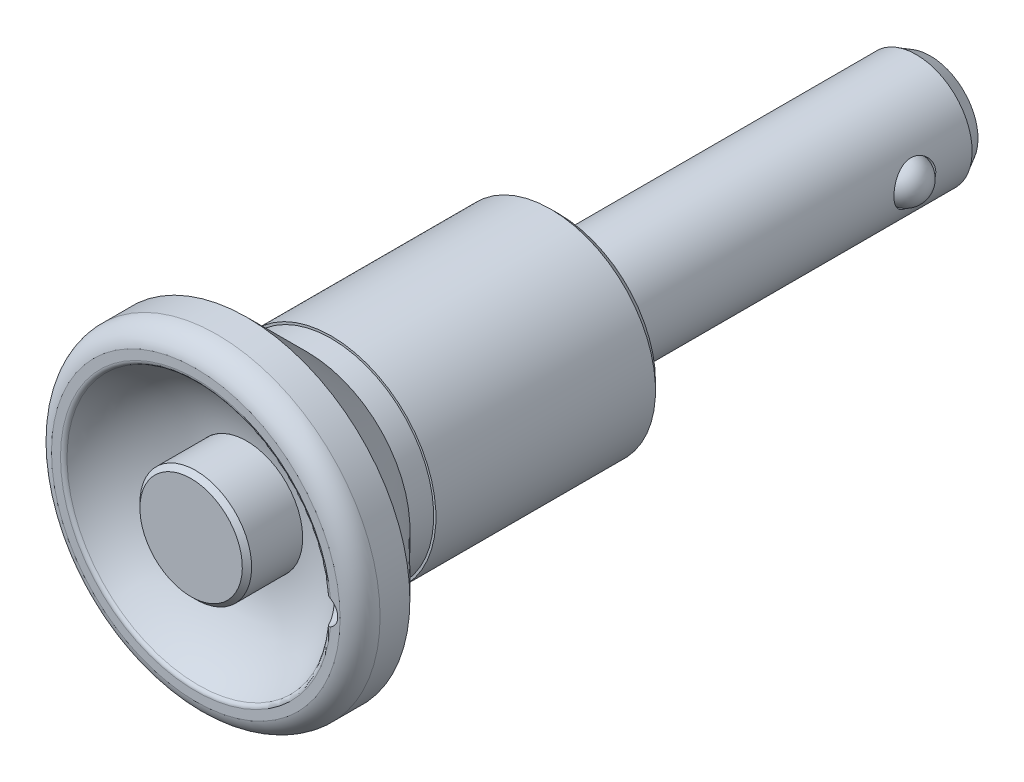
ISO-10303-21;
HEADER;
FILE_DESCRIPTION(('STEP AP214'),'2;1');
FILE_NAME('part.step','',(''),(''),'','','');
FILE_SCHEMA(('AUTOMOTIVE_DESIGN { 1 0 10303 214 1 1 1 1 }'));
ENDSEC;
DATA;
#1=APPLICATION_CONTEXT('core data for automotive mechanical design processes');
#2=APPLICATION_PROTOCOL_DEFINITION('international standard','automotive_design',2000,#1);
#3=PRODUCT_CONTEXT('',#1,'mechanical');
#4=PRODUCT('Part','Part','',(#3));
#5=PRODUCT_RELATED_PRODUCT_CATEGORY('part','',(#4));
#6=PRODUCT_DEFINITION_FORMATION('','',#4);
#7=PRODUCT_DEFINITION_CONTEXT('part definition',#1,'design');
#8=PRODUCT_DEFINITION('design','',#6,#7);
#9=PRODUCT_DEFINITION_SHAPE('','',#8);
#10=(LENGTH_UNIT() NAMED_UNIT(*) SI_UNIT(.MILLI.,.METRE.));
#11=(NAMED_UNIT(*) PLANE_ANGLE_UNIT() SI_UNIT($,.RADIAN.));
#12=(NAMED_UNIT(*) SI_UNIT($,.STERADIAN.) SOLID_ANGLE_UNIT());
#13=UNCERTAINTY_MEASURE_WITH_UNIT(LENGTH_MEASURE(1.E-05),#10,'distance_accuracy_value','');
#14=(GEOMETRIC_REPRESENTATION_CONTEXT(3) GLOBAL_UNCERTAINTY_ASSIGNED_CONTEXT((#13)) GLOBAL_UNIT_ASSIGNED_CONTEXT((#10,
#11,#12)) REPRESENTATION_CONTEXT('',''));
#15=CARTESIAN_POINT('',(0.,0.,0.));
#16=DIRECTION('',(0.,0.,1.));
#17=DIRECTION('',(1.,0.,0.));
#18=AXIS2_PLACEMENT_3D('',#15,#16,#17);
#19=CARTESIAN_POINT('',(0.,0.,-39.9));
#20=DIRECTION('',(0.,0.,-1.));
#21=DIRECTION('',(0.,1.,0.));
#22=AXIS2_PLACEMENT_3D('',#19,#20,#21);
#23=CYLINDRICAL_SURFACE('',#22,6.);
#24=CARTESIAN_POINT('',(-5.56214886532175,2.25,-32.25));
#25=CARTESIAN_POINT('',(-5.5621446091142,2.25000456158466,-32.1284887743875));
#26=CARTESIAN_POINT('',(-5.56617390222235,2.24012396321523,-32.0070076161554));
#27=CARTESIAN_POINT('',(-5.58174238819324,2.20104281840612,-31.7677078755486));
#28=CARTESIAN_POINT('',(-5.59328135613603,2.17184285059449,-31.6498891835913));
#29=CARTESIAN_POINT('',(-5.62238220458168,2.09534486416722,-31.4214369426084));
#30=CARTESIAN_POINT('',(-5.63992964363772,2.04809020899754,-31.3107869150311));
#31=CARTESIAN_POINT('',(-5.67904701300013,1.93697785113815,-31.098942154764));
#32=CARTESIAN_POINT('',(-5.70061815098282,1.87311516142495,-30.9977502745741));
#33=CARTESIAN_POINT('',(-5.74655362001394,1.7271999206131,-30.802664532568));
#34=CARTESIAN_POINT('',(-5.77100012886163,1.64445571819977,-30.7093072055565));
#35=CARTESIAN_POINT('',(-5.81924625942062,1.46459375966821,-30.5374157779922));
#36=CARTESIAN_POINT('',(-5.84304574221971,1.36747294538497,-30.4588848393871));
#37=CARTESIAN_POINT('',(-5.88829310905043,1.15754198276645,-30.3162907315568));
#38=CARTESIAN_POINT('',(-5.90963341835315,1.04431042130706,-30.2528107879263));
#39=CARTESIAN_POINT('',(-5.94657011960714,0.807833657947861,-30.1460232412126));
#40=CARTESIAN_POINT('',(-5.96216850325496,0.684591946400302,-30.102708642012));
#41=CARTESIAN_POINT('',(-5.98528045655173,0.437234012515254,-30.0393631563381));
#42=CARTESIAN_POINT('',(-5.99311372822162,0.313384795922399,-30.0184085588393));
#43=CARTESIAN_POINT('',(-6.0009602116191,0.0636965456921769,-29.9974181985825));
#44=CARTESIAN_POINT('',(-6.00097596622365,-0.0621418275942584,-29.997375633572));
#45=CARTESIAN_POINT('',(-5.9933889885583,-0.305615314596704,-30.0176726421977));
#46=CARTESIAN_POINT('',(-5.9861631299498,-0.423348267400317,-30.0370039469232));
#47=CARTESIAN_POINT('',(-5.96539912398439,-0.653758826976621,-30.0938038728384));
#48=CARTESIAN_POINT('',(-5.95186052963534,-0.766436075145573,-30.1312737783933));
#49=CARTESIAN_POINT('',(-5.91956653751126,-0.985483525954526,-30.2237556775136));
#50=CARTESIAN_POINT('',(-5.90073809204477,-1.09173808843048,-30.2790150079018));
#51=CARTESIAN_POINT('',(-5.85976965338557,-1.29372991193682,-30.4052881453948));
#52=CARTESIAN_POINT('',(-5.83762859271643,-1.38946376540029,-30.4763070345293));
#53=CARTESIAN_POINT('',(-5.79078794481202,-1.57363573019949,-30.6369409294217));
#54=CARTESIAN_POINT('',(-5.76601445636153,-1.6613192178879,-30.727400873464));
#55=CARTESIAN_POINT('',(-5.71773690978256,-1.82055593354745,-30.921889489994));
#56=CARTESIAN_POINT('',(-5.69423317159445,-1.89210511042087,-31.0259215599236));
#57=CARTESIAN_POINT('',(-5.65069055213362,-2.01848417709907,-31.247579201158));
#58=CARTESIAN_POINT('',(-5.63074015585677,-2.07290771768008,-31.3654552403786));
#59=CARTESIAN_POINT('',(-5.59758657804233,-2.16084696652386,-31.6096443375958));
#60=CARTESIAN_POINT('',(-5.58437964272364,-2.19437430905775,-31.7359526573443));
#61=CARTESIAN_POINT('',(-5.56709395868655,-2.23785287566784,-31.9859639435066));
#62=CARTESIAN_POINT('',(-5.56255177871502,-2.24900281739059,-32.109426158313));
#63=CARTESIAN_POINT('',(-5.56179809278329,-2.25086828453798,-32.3565140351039));
#64=CARTESIAN_POINT('',(-5.56558450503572,-2.24158891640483,-32.4801396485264));
#65=CARTESIAN_POINT('',(-5.58059072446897,-2.20394600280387,-32.7178948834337));
#66=CARTESIAN_POINT('',(-5.59144914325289,-2.17650927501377,-32.8321967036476));
#67=CARTESIAN_POINT('',(-5.61894730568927,-2.10449661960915,-33.0545219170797));
#68=CARTESIAN_POINT('',(-5.63558823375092,-2.05991718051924,-33.1625440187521));
#69=CARTESIAN_POINT('',(-5.67354364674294,-1.95300438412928,-33.3737466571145));
#70=CARTESIAN_POINT('',(-5.69500993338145,-1.89006817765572,-33.4765939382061));
#71=CARTESIAN_POINT('',(-5.7399422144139,-1.74886976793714,-33.670693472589));
#72=CARTESIAN_POINT('',(-5.76340893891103,-1.67060195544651,-33.7619414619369));
#73=CARTESIAN_POINT('',(-5.8114956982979,-1.49509101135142,-33.9362525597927));
#74=CARTESIAN_POINT('',(-5.83609454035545,-1.3969595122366,-34.0184301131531));
#75=CARTESIAN_POINT('',(-5.88224812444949,-1.18769620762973,-34.1652575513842));
#76=CARTESIAN_POINT('',(-5.90380285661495,-1.07656435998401,-34.2299073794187));
#77=CARTESIAN_POINT('',(-5.94142478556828,-0.844524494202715,-34.3394190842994));
#78=CARTESIAN_POINT('',(-5.95751072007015,-0.723651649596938,-34.3843486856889));
#79=CARTESIAN_POINT('',(-5.98244155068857,-0.475322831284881,-34.4529846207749));
#80=CARTESIAN_POINT('',(-5.99128984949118,-0.347869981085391,-34.4767009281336));
#81=CARTESIAN_POINT('',(-6.0004261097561,-0.0980033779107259,-34.5011616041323));
#82=CARTESIAN_POINT('',(-6.00118291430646,0.0242711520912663,-34.5031642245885));
#83=CARTESIAN_POINT('',(-5.99527334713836,0.267340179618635,-34.4873772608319));
#84=CARTESIAN_POINT('',(-5.98860787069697,0.388134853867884,-34.4695900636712));
#85=CARTESIAN_POINT('',(-5.96881634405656,0.62182237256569,-34.4156117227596));
#86=CARTESIAN_POINT('',(-5.95585187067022,0.734836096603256,-34.3798801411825));
#87=CARTESIAN_POINT('',(-5.92481675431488,0.95327320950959,-34.2914849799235));
#88=CARTESIAN_POINT('',(-5.90674514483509,1.05869515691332,-34.2388181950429));
#89=CARTESIAN_POINT('',(-5.86635927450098,1.26381026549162,-34.1155290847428));
#90=CARTESIAN_POINT('',(-5.8438986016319,1.36307632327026,-34.0442450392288));
#91=CARTESIAN_POINT('',(-5.79749261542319,1.54862602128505,-33.8867882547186));
#92=CARTESIAN_POINT('',(-5.77354677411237,1.63490500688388,-33.8006102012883));
#93=CARTESIAN_POINT('',(-5.72532194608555,1.7967182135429,-33.6104038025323));
#94=CARTESIAN_POINT('',(-5.70109208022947,1.87144499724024,-33.5056733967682));
#95=CARTESIAN_POINT('',(-5.65647487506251,2.00227064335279,-33.2843761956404));
#96=CARTESIAN_POINT('',(-5.6360879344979,2.05836757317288,-33.1678081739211));
#97=CARTESIAN_POINT('',(-5.60103404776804,2.15198830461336,-32.9205664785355));
#98=CARTESIAN_POINT('',(-5.58665704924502,2.18859004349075,-32.7894984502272));
#99=CARTESIAN_POINT('',(-5.56721991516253,2.23758535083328,-32.5222720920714));
#100=CARTESIAN_POINT('',(-5.56215363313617,2.24999489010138,-32.3861171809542));
#101=CARTESIAN_POINT('',(-5.56214886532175,2.25,-32.25));
#102=B_SPLINE_CURVE_WITH_KNOTS('',3,(#24,#25,#26,#27,#28,#29,#30,#31,#32,#33,#34,#35,#36,#37,
#38,#39,#40,#41,#42,#43,#44,#45,#46,#47,#48,#49,#50,#51,#52,#53,#54,#55,#56,#57,#58,#59,#60,#61,
#62,#63,#64,#65,#66,#67,#68,#69,#70,#71,#72,#73,#74,#75,#76,#77,#78,#79,#80,#81,#82,#83,#84,#85,
#86,#87,#88,#89,#90,#91,#92,#93,#94,#95,#96,#97,#98,#99,#100,#101),.UNSPECIFIED.,.T.,.F.,(4,2,2,
2,2,2,2,2,2,2,2,2,2,2,2,2,2,2,2,2,2,2,2,2,2,2,2,2,2,2,2,2,2,2,2,2,2,2,4),(0.,0.364026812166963,
0.728042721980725,1.09118978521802,1.45444601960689,1.83411978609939,2.2138744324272,
2.60655108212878,2.99909139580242,3.37470027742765,3.75018698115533,4.10709709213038,
4.4640324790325,4.82616196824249,5.18840840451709,5.57185012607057,5.95538801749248,
6.34743888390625,6.73927127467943,7.10948486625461,7.4796059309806,7.83215768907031,
8.18478170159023,8.55062341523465,8.91659922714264,9.30577525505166,9.69495254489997,
10.0827826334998,10.4704302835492,10.8354858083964,11.2004973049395,11.5566041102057,
11.9127783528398,12.2839248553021,12.6552040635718,13.0460789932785,13.436994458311,
13.8450476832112,14.2528314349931),.UNSPECIFIED.);
#103=CARTESIAN_POINT('',(-5.56214886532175,2.25,-32.25));
#104=VERTEX_POINT('',#103);
#105=EDGE_CURVE('E68',#104,#104,#102,.T.);
#106=ORIENTED_EDGE('',*,*,#105,.T.);
#107=EDGE_LOOP('',(#106));
#108=FACE_BOUND('',#107,.T.);
#109=CARTESIAN_POINT('',(0.,0.,-38.4));
#110=DIRECTION('',(0.,0.,-1.));
#111=DIRECTION('',(0.,1.,0.));
#112=AXIS2_PLACEMENT_3D('',#109,#110,#111);
#113=CIRCLE('',#112,6.);
#114=CARTESIAN_POINT('',(0.,6.,-38.4));
#115=VERTEX_POINT('',#114);
#116=EDGE_CURVE('E309',#115,#115,#113,.T.);
#117=ORIENTED_EDGE('',*,*,#116,.F.);
#118=EDGE_LOOP('',(#117));
#119=FACE_BOUND('',#118,.T.);
#120=CARTESIAN_POINT('',(5.56214886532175,2.25,-32.25));
#121=CARTESIAN_POINT('',(5.5621446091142,2.25000456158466,-32.3715112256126));
#122=CARTESIAN_POINT('',(5.56617390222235,2.24012396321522,-32.4929923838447));
#123=CARTESIAN_POINT('',(5.58174238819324,2.20104281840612,-32.7322921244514));
#124=CARTESIAN_POINT('',(5.59328135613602,2.17184285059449,-32.8501108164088));
#125=CARTESIAN_POINT('',(5.62238220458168,2.09534486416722,-33.0785630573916));
#126=CARTESIAN_POINT('',(5.63992964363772,2.04809020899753,-33.1892130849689));
#127=CARTESIAN_POINT('',(5.67904701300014,1.93697785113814,-33.401057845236));
#128=CARTESIAN_POINT('',(5.70061815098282,1.87311516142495,-33.5022497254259));
#129=CARTESIAN_POINT('',(5.74655362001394,1.7271999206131,-33.697335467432));
#130=CARTESIAN_POINT('',(5.77100012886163,1.64445571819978,-33.7906927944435));
#131=CARTESIAN_POINT('',(5.81924625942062,1.46459375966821,-33.9625842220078));
#132=CARTESIAN_POINT('',(5.84304574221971,1.36747294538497,-34.0411151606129));
#133=CARTESIAN_POINT('',(5.88829310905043,1.15754198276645,-34.1837092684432));
#134=CARTESIAN_POINT('',(5.90963341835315,1.04431042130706,-34.2471892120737));
#135=CARTESIAN_POINT('',(5.94657011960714,0.807833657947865,-34.3539767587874));
#136=CARTESIAN_POINT('',(5.96216850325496,0.684591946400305,-34.397291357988));
#137=CARTESIAN_POINT('',(5.98528045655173,0.437234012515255,-34.4606368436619));
#138=CARTESIAN_POINT('',(5.99311372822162,0.313384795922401,-34.4815914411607));
#139=CARTESIAN_POINT('',(6.0009602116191,0.0636965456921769,-34.5025818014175));
#140=CARTESIAN_POINT('',(6.00097596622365,-0.062141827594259,-34.5026243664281));
#141=CARTESIAN_POINT('',(5.9933889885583,-0.305615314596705,-34.4823273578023));
#142=CARTESIAN_POINT('',(5.9861631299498,-0.423348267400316,-34.4629960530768));
#143=CARTESIAN_POINT('',(5.96539912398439,-0.653758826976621,-34.4061961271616));
#144=CARTESIAN_POINT('',(5.95186052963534,-0.766436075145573,-34.3687262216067));
#145=CARTESIAN_POINT('',(5.91956653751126,-0.985483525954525,-34.2762443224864));
#146=CARTESIAN_POINT('',(5.90073809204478,-1.09173808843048,-34.2209849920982));
#147=CARTESIAN_POINT('',(5.85976965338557,-1.29372991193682,-34.0947118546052));
#148=CARTESIAN_POINT('',(5.83762859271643,-1.38946376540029,-34.0236929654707));
#149=CARTESIAN_POINT('',(5.79078794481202,-1.57363573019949,-33.8630590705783));
#150=CARTESIAN_POINT('',(5.76601445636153,-1.6613192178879,-33.772599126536));
#151=CARTESIAN_POINT('',(5.71773690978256,-1.82055593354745,-33.578110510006));
#152=CARTESIAN_POINT('',(5.69423317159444,-1.89210511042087,-33.4740784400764));
#153=CARTESIAN_POINT('',(5.65069055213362,-2.01848417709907,-33.252420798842));
#154=CARTESIAN_POINT('',(5.63074015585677,-2.07290771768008,-33.1345447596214));
#155=CARTESIAN_POINT('',(5.59758657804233,-2.16084696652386,-32.8903556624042));
#156=CARTESIAN_POINT('',(5.58437964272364,-2.19437430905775,-32.7640473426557));
#157=CARTESIAN_POINT('',(5.56709395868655,-2.23785287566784,-32.5140360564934));
#158=CARTESIAN_POINT('',(5.56255177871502,-2.24900281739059,-32.390573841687));
#159=CARTESIAN_POINT('',(5.56179809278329,-2.25086828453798,-32.1434859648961));
#160=CARTESIAN_POINT('',(5.56558450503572,-2.24158891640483,-32.0198603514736));
#161=CARTESIAN_POINT('',(5.58059072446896,-2.20394600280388,-31.7821051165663));
#162=CARTESIAN_POINT('',(5.59144914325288,-2.17650927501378,-31.6678032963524));
#163=CARTESIAN_POINT('',(5.61894730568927,-2.10449661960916,-31.4454780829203));
#164=CARTESIAN_POINT('',(5.63558823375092,-2.05991718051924,-31.337455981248));
#165=CARTESIAN_POINT('',(5.67354364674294,-1.95300438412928,-31.1262533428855));
#166=CARTESIAN_POINT('',(5.69500993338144,-1.89006817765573,-31.023406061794));
#167=CARTESIAN_POINT('',(5.7399422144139,-1.74886976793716,-30.829306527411));
#168=CARTESIAN_POINT('',(5.76340893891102,-1.67060195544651,-30.7380585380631));
#169=CARTESIAN_POINT('',(5.8114956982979,-1.49509101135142,-30.5637474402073));
#170=CARTESIAN_POINT('',(5.83609454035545,-1.39695951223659,-30.4815698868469));
#171=CARTESIAN_POINT('',(5.88224812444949,-1.18769620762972,-30.3347424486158));
#172=CARTESIAN_POINT('',(5.90380285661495,-1.07656435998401,-30.2700926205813));
#173=CARTESIAN_POINT('',(5.94142478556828,-0.844524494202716,-30.1605809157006));
#174=CARTESIAN_POINT('',(5.95751072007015,-0.723651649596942,-30.1156513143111));
#175=CARTESIAN_POINT('',(5.98244155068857,-0.475322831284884,-30.0470153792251));
#176=CARTESIAN_POINT('',(5.99128984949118,-0.347869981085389,-30.0232990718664));
#177=CARTESIAN_POINT('',(6.0004261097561,-0.0980033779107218,-29.9988383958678));
#178=CARTESIAN_POINT('',(6.00118291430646,0.0242711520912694,-29.9968357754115));
#179=CARTESIAN_POINT('',(5.99527334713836,0.267340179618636,-30.0126227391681));
#180=CARTESIAN_POINT('',(5.98860787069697,0.388134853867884,-30.0304099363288));
#181=CARTESIAN_POINT('',(5.96881634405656,0.621822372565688,-30.0843882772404));
#182=CARTESIAN_POINT('',(5.95585187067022,0.734836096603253,-30.1201198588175));
#183=CARTESIAN_POINT('',(5.92481675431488,0.953273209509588,-30.2085150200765));
#184=CARTESIAN_POINT('',(5.90674514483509,1.05869515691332,-30.2611818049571));
#185=CARTESIAN_POINT('',(5.86635927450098,1.26381026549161,-30.3844709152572));
#186=CARTESIAN_POINT('',(5.8438986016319,1.36307632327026,-30.4557549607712));
#187=CARTESIAN_POINT('',(5.79749261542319,1.54862602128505,-30.6132117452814));
#188=CARTESIAN_POINT('',(5.77354677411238,1.63490500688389,-30.6993897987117));
#189=CARTESIAN_POINT('',(5.72532194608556,1.7967182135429,-30.8895961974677));
#190=CARTESIAN_POINT('',(5.70109208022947,1.87144499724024,-30.9943266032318));
#191=CARTESIAN_POINT('',(5.6564748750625,2.00227064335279,-31.2156238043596));
#192=CARTESIAN_POINT('',(5.63608793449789,2.05836757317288,-31.3321918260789));
#193=CARTESIAN_POINT('',(5.60103404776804,2.15198830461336,-31.5794335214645));
#194=CARTESIAN_POINT('',(5.58665704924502,2.18859004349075,-31.7105015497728));
#195=CARTESIAN_POINT('',(5.56721991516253,2.23758535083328,-31.9777279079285));
#196=CARTESIAN_POINT('',(5.56215363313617,2.24999489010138,-32.1138828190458));
#197=CARTESIAN_POINT('',(5.56214886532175,2.25,-32.25));
#198=B_SPLINE_CURVE_WITH_KNOTS('',3,(#120,#121,#122,#123,#124,#125,#126,#127,#128,#129,#130,
#131,#132,#133,#134,#135,#136,#137,#138,#139,#140,#141,#142,#143,#144,#145,#146,#147,#148,#149,
#150,#151,#152,#153,#154,#155,#156,#157,#158,#159,#160,#161,#162,#163,#164,#165,#166,#167,#168,
#169,#170,#171,#172,#173,#174,#175,#176,#177,#178,#179,#180,#181,#182,#183,#184,#185,#186,#187,
#188,#189,#190,#191,#192,#193,#194,#195,#196,#197),.UNSPECIFIED.,.T.,.F.,(4,2,2,2,2,2,2,2,2,2,2,
2,2,2,2,2,2,2,2,2,2,2,2,2,2,2,2,2,2,2,2,2,2,2,2,2,2,2,4),(0.,0.364026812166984,
0.728042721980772,1.09118978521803,1.45444601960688,1.83411978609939,2.2138744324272,
2.60655108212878,2.99909139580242,3.37470027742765,3.75018698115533,4.10709709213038,
4.4640324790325,4.82616196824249,5.1884084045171,5.57185012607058,5.95538801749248,
6.34743888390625,6.73927127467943,7.10948486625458,7.47960593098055,7.83215768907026,
8.18478170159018,8.55062341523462,8.91659922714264,9.30577525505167,9.69495254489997,
10.0827826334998,10.4704302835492,10.8354858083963,11.2004973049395,11.5566041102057,
11.9127783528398,12.2839248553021,12.6552040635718,13.0460789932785,13.4369944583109,
13.8450476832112,14.2528314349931),.UNSPECIFIED.);
#199=CARTESIAN_POINT('',(5.56214886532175,2.25,-32.25));
#200=VERTEX_POINT('',#199);
#201=EDGE_CURVE('E287',#200,#200,#198,.T.);
#202=ORIENTED_EDGE('',*,*,#201,.T.);
#203=EDGE_LOOP('',(#202));
#204=FACE_BOUND('',#203,.T.);
#205=CARTESIAN_POINT('',(0.,0.,0.));
#206=DIRECTION('',(0.,0.,1.));
#207=DIRECTION('',(1.,0.,0.));
#208=AXIS2_PLACEMENT_3D('',#205,#206,#207);
#209=CIRCLE('',#208,6.);
#210=CARTESIAN_POINT('',(6.,0.,0.));
#211=VERTEX_POINT('',#210);
#212=EDGE_CURVE('E80',#211,#211,#209,.T.);
#213=ORIENTED_EDGE('',*,*,#212,.F.);
#214=EDGE_LOOP('',(#213));
#215=FACE_BOUND('',#214,.T.);
#216=ADVANCED_FACE('F14',(#108,#119,#204,#215),#23,.T.);
#217=CARTESIAN_POINT('',(0.,0.,-39.9));
#218=DIRECTION('',(0.,0.,-1.));
#219=DIRECTION('',(0.,1.,0.));
#220=AXIS2_PLACEMENT_3D('',#217,#218,#219);
#221=CYLINDRICAL_SURFACE('',#220,2.75);
#222=CARTESIAN_POINT('',(0.,0.,-34.5));
#223=DIRECTION('',(0.,0.,-1.));
#224=DIRECTION('',(0.,1.,0.));
#225=AXIS2_PLACEMENT_3D('',#222,#223,#224);
#226=CIRCLE('',#225,2.75);
#227=CARTESIAN_POINT('',(0.,2.75,-34.5));
#228=VERTEX_POINT('',#227);
#229=EDGE_CURVE('E74',#228,#228,#226,.T.);
#230=ORIENTED_EDGE('',*,*,#229,.F.);
#231=EDGE_LOOP('',(#230));
#232=FACE_BOUND('',#231,.T.);
#233=CARTESIAN_POINT('',(0.,0.,-39.9));
#234=DIRECTION('',(0.,0.,-1.));
#235=DIRECTION('',(0.,1.,0.));
#236=AXIS2_PLACEMENT_3D('',#233,#234,#235);
#237=CIRCLE('',#236,2.75);
#238=CARTESIAN_POINT('',(0.,2.75,-39.9));
#239=VERTEX_POINT('',#238);
#240=EDGE_CURVE('E301',#239,#239,#237,.T.);
#241=ORIENTED_EDGE('',*,*,#240,.T.);
#242=EDGE_LOOP('',(#241));
#243=FACE_BOUND('',#242,.T.);
#244=ADVANCED_FACE('F269',(#232,#243),#221,.F.);
#245=CARTESIAN_POINT('',(2.75,0.,-39.9));
#246=DIRECTION('',(0.,0.,-1.));
#247=DIRECTION('',(0.,1.,0.));
#248=AXIS2_PLACEMENT_3D('',#245,#246,#247);
#249=PLANE('',#248);
#250=CARTESIAN_POINT('',(0.,0.,-39.9));
#251=DIRECTION('',(0.,0.,-1.));
#252=DIRECTION('',(0.,1.,0.));
#253=AXIS2_PLACEMENT_3D('',#250,#251,#252);
#254=CIRCLE('',#253,5.13397459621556);
#255=CARTESIAN_POINT('',(0.,5.13397459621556,-39.9));
#256=VERTEX_POINT('',#255);
#257=EDGE_CURVE('E305',#256,#256,#254,.T.);
#258=ORIENTED_EDGE('',*,*,#257,.T.);
#259=EDGE_LOOP('',(#258));
#260=FACE_BOUND('',#259,.T.);
#261=ORIENTED_EDGE('',*,*,#240,.F.);
#262=EDGE_LOOP('',(#261));
#263=FACE_BOUND('',#262,.T.);
#264=ADVANCED_FACE('F275',(#260,#263),#249,.T.);
#265=CARTESIAN_POINT('',(0.,0.,-39.9));
#266=DIRECTION('',(0.,0.,1.));
#267=DIRECTION('',(0.,-1.,0.));
#268=AXIS2_PLACEMENT_3D('',#265,#266,#267);
#269=CONICAL_SURFACE('',#268,5.13397459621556,0.523598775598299);
#270=ORIENTED_EDGE('',*,*,#116,.T.);
#271=EDGE_LOOP('',(#270));
#272=FACE_BOUND('',#271,.T.);
#273=ORIENTED_EDGE('',*,*,#257,.F.);
#274=EDGE_LOOP('',(#273));
#275=FACE_BOUND('',#274,.T.);
#276=ADVANCED_FACE('F283',(#272,#275),#269,.T.);
#277=CARTESIAN_POINT('',(7.,0.,-32.25));
#278=DIRECTION('',(1.,0.,0.));
#279=DIRECTION('',(0.,1.,0.));
#280=AXIS2_PLACEMENT_3D('',#277,#278,#279);
#281=CYLINDRICAL_SURFACE('',#280,2.25);
#282=CARTESIAN_POINT('',(4.70120856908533,2.25,-32.25));
#283=CARTESIAN_POINT('',(4.70121469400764,2.24999417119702,-32.1304590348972));
#284=CARTESIAN_POINT('',(4.70583400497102,2.24041261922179,-32.0107125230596));
#285=CARTESIAN_POINT('',(4.72369711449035,2.20249080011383,-31.7747180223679));
#286=CARTESIAN_POINT('',(4.73696351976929,2.17410135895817,-31.6584800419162));
#287=CARTESIAN_POINT('',(4.77031963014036,2.09989154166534,-31.4333349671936));
#288=CARTESIAN_POINT('',(4.79038009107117,2.05414577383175,-31.324398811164));
#289=CARTESIAN_POINT('',(4.83501981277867,1.94674472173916,-31.1157771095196));
#290=CARTESIAN_POINT('',(4.85959823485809,1.88509238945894,-31.016089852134));
#291=CARTESIAN_POINT('',(4.91234222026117,1.74321937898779,-30.8220680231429));
#292=CARTESIAN_POINT('',(4.94063496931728,1.66209866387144,-30.7284258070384));
#293=CARTESIAN_POINT('',(4.99657815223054,1.48547872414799,-30.5555585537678));
#294=CARTESIAN_POINT('',(5.02422832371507,1.38997374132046,-30.4763393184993));
#295=CARTESIAN_POINT('',(5.07733633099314,1.18176930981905,-30.3309420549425));
#296=CARTESIAN_POINT('',(5.10262925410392,1.06847133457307,-30.2655553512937));
#297=CARTESIAN_POINT('',(5.14660113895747,0.831192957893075,-30.1550726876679));
#298=CARTESIAN_POINT('',(5.16528324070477,0.707217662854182,-30.1099670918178));
#299=CARTESIAN_POINT('',(5.1930243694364,0.459385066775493,-30.0438746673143));
#300=CARTESIAN_POINT('',(5.20255899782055,0.335901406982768,-30.0216905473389));
#301=CARTESIAN_POINT('',(5.21266651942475,0.0866213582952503,-29.9981895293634));
#302=CARTESIAN_POINT('',(5.21324333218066,-0.0391739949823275,-29.9968635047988));
#303=CARTESIAN_POINT('',(5.20564133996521,-0.280752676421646,-30.0145162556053));
#304=CARTESIAN_POINT('',(5.19803132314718,-0.396653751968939,-30.0321759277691));
#305=CARTESIAN_POINT('',(5.17570524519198,-0.623658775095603,-30.0850210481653));
#306=CARTESIAN_POINT('',(5.16098865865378,-0.734762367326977,-30.1202077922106));
#307=CARTESIAN_POINT('',(5.12557562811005,-0.951074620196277,-30.2075078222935));
#308=CARTESIAN_POINT('',(5.10479112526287,-1.05616705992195,-30.2598718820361));
#309=CARTESIAN_POINT('',(5.05924909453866,-1.25634985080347,-30.3797828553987));
#310=CARTESIAN_POINT('',(5.03449013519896,-1.35143657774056,-30.4473352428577));
#311=CARTESIAN_POINT('',(4.9812692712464,-1.53647964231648,-30.6015757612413));
#312=CARTESIAN_POINT('',(4.95266891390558,-1.6255187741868,-30.689317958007));
#313=CARTESIAN_POINT('',(4.89634671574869,-1.7880335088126,-30.8785052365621));
#314=CARTESIAN_POINT('',(4.8686252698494,-1.86150219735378,-30.9799563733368));
#315=CARTESIAN_POINT('',(4.81616806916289,-1.99339518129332,-31.1984520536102));
#316=CARTESIAN_POINT('',(4.79158303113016,-2.05115292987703,-31.3159383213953));
#317=CARTESIAN_POINT('',(4.75001097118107,-2.14568300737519,-31.5603104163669));
#318=CARTESIAN_POINT('',(4.73301805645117,-2.18247161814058,-31.6871888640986));
#319=CARTESIAN_POINT('',(4.7100473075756,-2.23159308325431,-31.9375319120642));
#320=CARTESIAN_POINT('',(4.70339790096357,-2.24542132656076,-32.0606401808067));
#321=CARTESIAN_POINT('',(4.69994279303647,-2.25264846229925,-32.3075714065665));
#322=CARTESIAN_POINT('',(4.70313324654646,-2.24605533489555,-32.4313940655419));
#323=CARTESIAN_POINT('',(4.71830050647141,-2.21399394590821,-32.6669653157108));
#324=CARTESIAN_POINT('',(4.72963794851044,-2.18989787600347,-32.778947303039));
#325=CARTESIAN_POINT('',(4.75898261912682,-2.12536894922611,-32.9971687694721));
#326=CARTESIAN_POINT('',(4.77699148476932,-2.08493208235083,-33.1034068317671));
#327=CARTESIAN_POINT('',(4.81860535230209,-1.98691927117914,-33.3123309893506));
#328=CARTESIAN_POINT('',(4.8424207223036,-1.92867086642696,-33.414658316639));
#329=CARTESIAN_POINT('',(4.89268495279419,-1.79734114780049,-33.6086003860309));
#330=CARTESIAN_POINT('',(4.91913500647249,-1.72425309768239,-33.7002102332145));
#331=CARTESIAN_POINT('',(4.97451487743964,-1.5576964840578,-33.8785741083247));
#332=CARTESIAN_POINT('',(5.00345675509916,-1.46299589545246,-33.9641786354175));
#333=CARTESIAN_POINT('',(5.05840859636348,-1.25992784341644,-34.11851397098));
#334=CARTESIAN_POINT('',(5.0844182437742,-1.15155890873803,-34.1872429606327));
#335=CARTESIAN_POINT('',(5.13083610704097,-0.92305594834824,-34.3059980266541));
#336=CARTESIAN_POINT('',(5.15121223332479,-0.802859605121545,-34.3559175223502));
#337=CARTESIAN_POINT('',(5.18380508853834,-0.554662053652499,-34.4344361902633));
#338=CARTESIAN_POINT('',(5.19602706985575,-0.426665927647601,-34.4630490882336));
#339=CARTESIAN_POINT('',(5.21029045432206,-0.176736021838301,-34.4963229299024));
#340=CARTESIAN_POINT('',(5.21301888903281,-0.0550554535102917,-34.5026010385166));
#341=CARTESIAN_POINT('',(5.20993078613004,0.187600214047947,-34.495446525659));
#342=CARTESIAN_POINT('',(5.2041159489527,0.308575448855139,-34.4820178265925));
#343=CARTESIAN_POINT('',(5.18496872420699,0.541359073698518,-34.436990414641));
#344=CARTESIAN_POINT('',(5.17194743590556,0.653340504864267,-34.4061426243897));
#345=CARTESIAN_POINT('',(5.13986314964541,0.870473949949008,-34.3280030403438));
#346=CARTESIAN_POINT('',(5.12079904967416,0.975624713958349,-34.2807082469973));
#347=CARTESIAN_POINT('',(5.07736891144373,1.18141977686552,-34.1686191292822));
#348=CARTESIAN_POINT('',(5.05280038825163,1.2816385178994,-34.1031238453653));
#349=CARTESIAN_POINT('',(5.00122306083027,1.47009921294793,-33.957485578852));
#350=CARTESIAN_POINT('',(4.9742132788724,1.5583363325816,-33.877336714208));
#351=CARTESIAN_POINT('',(4.9182708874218,1.72712341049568,-33.6976966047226));
#352=CARTESIAN_POINT('',(4.88934356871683,1.80662459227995,-33.5972140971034));
#353=CARTESIAN_POINT('',(4.83482876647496,1.94782882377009,-33.3835276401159));
#354=CARTESIAN_POINT('',(4.80924325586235,2.00952138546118,-33.270316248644));
#355=CARTESIAN_POINT('',(4.76470338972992,2.11297708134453,-33.0338474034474));
#356=CARTESIAN_POINT('',(4.74574393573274,2.15475554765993,-32.9105977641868));
#357=CARTESIAN_POINT('',(4.72435108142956,2.20105394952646,-32.7212685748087));
#358=CARTESIAN_POINT('',(4.71839681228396,2.21375426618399,-32.6574783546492));
#359=CARTESIAN_POINT('',(4.70903769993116,2.23359624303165,-32.5288695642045));
#360=CARTESIAN_POINT('',(4.70563091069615,2.2407421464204,-32.4640518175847));
#361=CARTESIAN_POINT('',(4.7027842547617,2.24670526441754,-32.3742341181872));
#362=CARTESIAN_POINT('',(4.7021941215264,2.24794009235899,-32.3494079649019));
#363=CARTESIAN_POINT('',(4.70140563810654,2.24958807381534,-32.2997241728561));
#364=CARTESIAN_POINT('',(4.70120729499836,2.25000121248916,-32.2748665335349));
#365=CARTESIAN_POINT('',(4.70120856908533,2.25,-32.25));
#366=B_SPLINE_CURVE_WITH_KNOTS('',3,(#282,#283,#284,#285,#286,#287,#288,#289,#290,#291,#292,
#293,#294,#295,#296,#297,#298,#299,#300,#301,#302,#303,#304,#305,#306,#307,#308,#309,#310,#311,
#312,#313,#314,#315,#316,#317,#318,#319,#320,#321,#322,#323,#324,#325,#326,#327,#328,#329,#330,
#331,#332,#333,#334,#335,#336,#337,#338,#339,#340,#341,#342,#343,#344,#345,#346,#347,#348,#349,
#350,#351,#352,#353,#354,#355,#356,#357,#358,#359,#360,#361,#362,#363,#364,#365),.UNSPECIFIED.,
.T.,.F.,(4,2,2,2,2,2,2,2,2,2,2,2,2,2,2,2,2,2,2,2,2,2,2,2,2,2,2,2,2,2,2,2,2,2,2,2,2,2,2,2,2,4),
(0.,0.358523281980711,0.717987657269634,1.07592402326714,1.43379401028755,1.81338979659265,
2.19313794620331,2.59079710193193,2.98826712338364,3.36372670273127,3.73902199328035,
4.08983186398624,4.4406676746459,4.79687203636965,5.15320497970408,5.53621810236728,
5.91940095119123,6.31693575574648,6.71416146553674,7.08432459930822,7.45434310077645,
7.79811230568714,8.14196592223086,8.50086375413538,8.85992486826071,9.25080120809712,
9.64171965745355,10.0348210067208,10.427668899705,10.7914180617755,11.1550948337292,
11.5041747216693,11.8533183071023,12.2184179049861,12.583664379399,12.9758816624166,
13.3683294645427,13.7604746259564,13.9561801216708,14.1517359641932,14.2263134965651,
14.3008923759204),.UNSPECIFIED.);
#367=CARTESIAN_POINT('',(4.84677342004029,1.91641577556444,-33.4289192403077));
#368=VERTEX_POINT('',#367);
#369=CARTESIAN_POINT('',(4.84677342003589,-1.91641577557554,-33.4289192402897));
#370=VERTEX_POINT('',#369);
#371=EDGE_CURVE('E70',#368,#370,#366,.T.);
#372=ORIENTED_EDGE('',*,*,#371,.F.);
#373=CARTESIAN_POINT('',(5.21189620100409,0.,-34.5));
#374=CARTESIAN_POINT('',(5.21189615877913,0.126284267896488,-34.4999948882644));
#375=CARTESIAN_POINT('',(5.21139467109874,0.252644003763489,-34.4893340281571));
#376=CARTESIAN_POINT('',(5.2093805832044,0.501864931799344,-34.4469613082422));
#377=CARTESIAN_POINT('',(5.20786696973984,0.624722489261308,-34.4152283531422));
#378=CARTESIAN_POINT('',(5.20380519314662,0.863320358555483,-34.3316208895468));
#379=CARTESIAN_POINT('',(5.20125743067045,0.979063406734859,-34.2797541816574));
#380=CARTESIAN_POINT('',(5.19508229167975,1.20015943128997,-34.1573752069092));
#381=CARTESIAN_POINT('',(5.19145518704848,1.30551501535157,-34.0868676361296));
#382=CARTESIAN_POINT('',(5.18303472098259,1.50291352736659,-33.9291996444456));
#383=CARTESIAN_POINT('',(5.17824107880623,1.59495324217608,-33.8420352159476));
#384=CARTESIAN_POINT('',(5.16733442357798,1.76311423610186,-33.653525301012));
#385=CARTESIAN_POINT('',(5.16122100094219,1.83923055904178,-33.5521754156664));
#386=CARTESIAN_POINT('',(5.14734400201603,1.97343552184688,-33.3381336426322));
#387=CARTESIAN_POINT('',(5.13957863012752,2.03150437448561,-33.2254294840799));
#388=CARTESIAN_POINT('',(5.12176723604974,2.1278284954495,-32.9921124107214));
#389=CARTESIAN_POINT('',(5.111724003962,2.16610781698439,-32.8715092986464));
#390=CARTESIAN_POINT('',(5.0933054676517,2.2077406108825,-32.6884429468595));
#391=CARTESIAN_POINT('',(5.08666779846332,2.21896106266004,-32.6275162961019));
#392=CARTESIAN_POINT('',(5.07117135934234,2.23631965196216,-32.505313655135));
#393=CARTESIAN_POINT('',(5.06231462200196,2.24246241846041,-32.444038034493));
#394=CARTESIAN_POINT('',(5.04473959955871,2.24786649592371,-32.3524947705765));
#395=CARTESIAN_POINT('',(5.03817832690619,2.24903385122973,-32.3220839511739));
#396=CARTESIAN_POINT('',(5.02487846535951,2.24972982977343,-32.2856268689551));
#397=CARTESIAN_POINT('',(5.02196282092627,2.24983087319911,-32.278411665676));
#398=CARTESIAN_POINT('',(5.01679668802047,2.24992122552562,-32.2690075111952));
#399=CARTESIAN_POINT('',(5.01524668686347,2.24994100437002,-32.266465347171));
#400=CARTESIAN_POINT('',(5.01258312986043,2.24996347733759,-32.2628773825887));
#401=CARTESIAN_POINT('',(5.01163231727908,2.24996978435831,-32.2617128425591));
#402=CARTESIAN_POINT('',(5.00957474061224,2.24998007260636,-32.2595306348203));
#403=CARTESIAN_POINT('',(5.00846878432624,2.24998406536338,-32.258512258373));
#404=CARTESIAN_POINT('',(5.0067156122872,2.2499883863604,-32.2572404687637));
#405=CARTESIAN_POINT('',(5.00615104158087,2.2499895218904,-32.2568745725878));
#406=CARTESIAN_POINT('',(5.00497729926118,2.2499914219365,-32.2562214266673));
#407=CARTESIAN_POINT('',(5.00436814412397,2.24999218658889,-32.2559341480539));
#408=CARTESIAN_POINT('',(5.00310140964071,2.24999338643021,-32.2554607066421));
#409=CARTESIAN_POINT('',(5.00244330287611,2.24999381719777,-32.2552759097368));
#410=CARTESIAN_POINT('',(5.0011038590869,2.24999436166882,-32.2550386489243));
#411=CARTESIAN_POINT('',(5.00042256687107,2.24999447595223,-32.2549859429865));
#412=CARTESIAN_POINT('',(4.99914424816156,2.24999440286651,-32.2550185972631));
#413=CARTESIAN_POINT('',(4.99854676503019,2.24999424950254,-32.2550883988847));
#414=CARTESIAN_POINT('',(4.99737209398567,2.24999369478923,-32.2553279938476));
#415=CARTESIAN_POINT('',(4.99679493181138,2.24999329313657,-32.2554979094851));
#416=CARTESIAN_POINT('',(4.99546550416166,2.24999202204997,-32.2559985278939));
#417=CARTESIAN_POINT('',(4.99472705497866,2.24999103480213,-32.2563654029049));
#418=CARTESIAN_POINT('',(4.99331619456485,2.24998849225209,-32.2572086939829));
#419=CARTESIAN_POINT('',(4.99264394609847,2.24998693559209,-32.257685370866));
#420=CARTESIAN_POINT('',(4.9907978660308,2.24998155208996,-32.2591607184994));
#421=CARTESIAN_POINT('',(4.98969889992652,2.24997693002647,-32.2602516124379));
#422=CARTESIAN_POINT('',(4.98765562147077,2.24996520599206,-32.2625688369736));
#423=CARTESIAN_POINT('',(4.98671188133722,2.249958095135,-32.2637956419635));
#424=CARTESIAN_POINT('',(4.98193653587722,2.2499128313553,-32.2705312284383));
#425=CARTESIAN_POINT('',(4.97899990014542,2.24985038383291,-32.2766418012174));
#426=CARTESIAN_POINT('',(4.97376920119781,2.24966896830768,-32.2891278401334));
#427=CARTESIAN_POINT('',(4.9714820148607,2.24954942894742,-32.2955053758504));
#428=CARTESIAN_POINT('',(4.96106149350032,2.24881762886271,-32.3271058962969));
#429=CARTESIAN_POINT('',(4.95530816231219,2.24778447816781,-32.3531043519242));
#430=CARTESIAN_POINT('',(4.94501184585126,2.24479018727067,-32.4053004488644));
#431=CARTESIAN_POINT('',(4.94047527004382,2.24282427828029,-32.4314984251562));
#432=CARTESIAN_POINT('',(4.92798476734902,2.23550007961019,-32.5104298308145));
#433=CARTESIAN_POINT('',(4.92120435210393,2.22872063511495,-32.5632520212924));
#434=CARTESIAN_POINT('',(4.90891131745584,2.21142389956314,-32.6682645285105));
#435=CARTESIAN_POINT('',(4.90339617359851,2.20091415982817,-32.7204559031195));
#436=CARTESIAN_POINT('',(4.88803764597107,2.1637301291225,-32.8762327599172));
#437=CARTESIAN_POINT('',(4.87942579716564,2.13143364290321,-32.9786677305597));
#438=CARTESIAN_POINT('',(4.86395279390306,2.05263870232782,-33.1776953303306));
#439=CARTESIAN_POINT('',(4.85708717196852,2.00617717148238,-33.2743023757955));
#440=CARTESIAN_POINT('',(4.84463430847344,1.89998698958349,-33.4599495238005));
#441=CARTESIAN_POINT('',(4.83904642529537,1.84026502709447,-33.5489934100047));
#442=CARTESIAN_POINT('',(4.82796886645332,1.69683921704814,-33.7329593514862));
#443=CARTESIAN_POINT('',(4.82267830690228,1.61075316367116,-33.8260495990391));
#444=CARTESIAN_POINT('',(4.81331124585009,1.42411005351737,-33.9965405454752));
#445=CARTESIAN_POINT('',(4.80923548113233,1.32354426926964,-34.0739317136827));
#446=CARTESIAN_POINT('',(4.80219403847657,1.11084101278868,-34.2107437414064));
#447=CARTESIAN_POINT('',(4.79922814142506,0.99870583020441,-34.270168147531));
#448=CARTESIAN_POINT('',(4.79434733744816,0.76604781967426,-34.3693541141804));
#449=CARTESIAN_POINT('',(4.7924323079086,0.645525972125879,-34.4091179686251));
#450=CARTESIAN_POINT('',(4.78962227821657,0.399571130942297,-34.4678412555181));
#451=CARTESIAN_POINT('',(4.78872674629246,0.27414073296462,-34.4868115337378));
#452=CARTESIAN_POINT('',(4.78794106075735,0.021870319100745,-34.5034420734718));
#453=CARTESIAN_POINT('',(4.78805091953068,-0.104969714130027,-34.5011020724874));
#454=CARTESIAN_POINT('',(4.78927737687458,-0.356418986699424,-34.4751821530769));
#455=CARTESIAN_POINT('',(4.79039368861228,-0.481028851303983,-34.4516082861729));
#456=CARTESIAN_POINT('',(4.79364906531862,-0.72451933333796,-34.3839024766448));
#457=CARTESIAN_POINT('',(4.79578813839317,-0.84339990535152,-34.3397703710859));
#458=CARTESIAN_POINT('',(4.80112512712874,-1.0720730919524,-34.2322025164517));
#459=CARTESIAN_POINT('',(4.80432317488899,-1.18186457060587,-34.1687643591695));
#460=CARTESIAN_POINT('',(4.81184515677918,-1.38922597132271,-34.0244041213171));
#461=CARTESIAN_POINT('',(4.81616903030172,-1.48679655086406,-33.9434829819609));
#462=CARTESIAN_POINT('',(4.82606445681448,-1.66699500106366,-33.7664389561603));
#463=CARTESIAN_POINT('',(4.83163644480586,-1.749617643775,-33.6703107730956));
#464=CARTESIAN_POINT('',(4.84427017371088,-1.89756793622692,-33.465602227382));
#465=CARTESIAN_POINT('',(4.85133233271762,-1.96289072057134,-33.3570183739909));
#466=CARTESIAN_POINT('',(4.86742332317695,-2.07443577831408,-33.1304409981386));
#467=CARTESIAN_POINT('',(4.87645418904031,-2.12063814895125,-33.0124378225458));
#468=CARTESIAN_POINT('',(4.89787609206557,-2.19253624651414,-32.7707327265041));
#469=CARTESIAN_POINT('',(4.9102638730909,-2.2182517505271,-32.6470364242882));
#470=CARTESIAN_POINT('',(4.93489152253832,-2.24079197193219,-32.4621887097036));
#471=CARTESIAN_POINT('',(4.9439209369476,-2.24567525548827,-32.4016395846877));
#472=CARTESIAN_POINT('',(4.96144377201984,-2.24865520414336,-32.3288938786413));
#473=CARTESIAN_POINT('',(4.96488235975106,-2.24907569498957,-32.3157504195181));
#474=CARTESIAN_POINT('',(4.97117438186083,-2.24953233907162,-32.2963421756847));
#475=CARTESIAN_POINT('',(4.97347535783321,-2.24965571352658,-32.2898919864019));
#476=CARTESIAN_POINT('',(4.97872381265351,-2.2498436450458,-32.277231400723));
#477=CARTESIAN_POINT('',(4.98166680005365,-2.24990859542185,-32.2710196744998));
#478=CARTESIAN_POINT('',(4.98649447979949,-2.24995636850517,-32.264083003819));
#479=CARTESIAN_POINT('',(4.98748893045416,-2.24996411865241,-32.2627698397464));
#480=CARTESIAN_POINT('',(4.98964936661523,-2.24997676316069,-32.2602966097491));
#481=CARTESIAN_POINT('',(4.99081420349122,-2.24998167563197,-32.2591356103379));
#482=CARTESIAN_POINT('',(4.99264559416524,-2.24998690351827,-32.2576897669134));
#483=CARTESIAN_POINT('',(4.9932154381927,-2.24998824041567,-32.2572839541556));
#484=CARTESIAN_POINT('',(4.9944037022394,-2.24999050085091,-32.2565481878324));
#485=CARTESIAN_POINT('',(4.99502214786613,-2.24999142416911,-32.2562182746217));
#486=CARTESIAN_POINT('',(4.99631433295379,-2.24999290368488,-32.2556581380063));
#487=CARTESIAN_POINT('',(4.99698872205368,-2.24999345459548,-32.2554293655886));
#488=CARTESIAN_POINT('',(4.99836895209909,-2.24999420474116,-32.2551094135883));
#489=CARTESIAN_POINT('',(4.99907470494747,-2.24999440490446,-32.2550178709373));
#490=CARTESIAN_POINT('',(5.00040115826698,-2.24999446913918,-32.2549888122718));
#491=CARTESIAN_POINT('',(5.00102150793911,-2.24999437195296,-32.2550335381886));
#492=CARTESIAN_POINT('',(5.00224443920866,-2.24999391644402,-32.2552331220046));
#493=CARTESIAN_POINT('',(5.00284699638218,-2.24999355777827,-32.2553881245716));
#494=CARTESIAN_POINT('',(5.00417868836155,-2.24999242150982,-32.2558452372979));
#495=CARTESIAN_POINT('',(5.00489786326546,-2.24999155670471,-32.2561758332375));
#496=CARTESIAN_POINT('',(5.00627531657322,-2.24998931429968,-32.2569451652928));
#497=CARTESIAN_POINT('',(5.00693345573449,-2.24998793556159,-32.2573841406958));
#498=CARTESIAN_POINT('',(5.00870837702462,-2.24998324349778,-32.2587256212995));
#499=CARTESIAN_POINT('',(5.00975965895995,-2.24997927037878,-32.2597134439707));
#500=CARTESIAN_POINT('',(5.0117195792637,-2.24996920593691,-32.2618205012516));
#501=CARTESIAN_POINT('',(5.01262772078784,-2.24996310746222,-32.2629401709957));
#502=CARTESIAN_POINT('',(5.0164076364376,-2.2499311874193,-32.2680200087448));
#503=CARTESIAN_POINT('',(5.01876364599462,-2.24989314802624,-32.2723506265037));
#504=CARTESIAN_POINT('',(5.02299212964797,-2.24978775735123,-32.2812382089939));
#505=CARTESIAN_POINT('',(5.02486105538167,-2.24972020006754,-32.2857965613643));
#506=CARTESIAN_POINT('',(5.03489036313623,-2.24924415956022,-32.3122210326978));
#507=CARTESIAN_POINT('',(5.04042841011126,-2.24850580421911,-32.3350346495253));
#508=CARTESIAN_POINT('',(5.05033017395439,-2.24631053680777,-32.3808965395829));
#509=CARTESIAN_POINT('',(5.05468563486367,-2.24484876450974,-32.4039453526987));
#510=CARTESIAN_POINT('',(5.06660405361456,-2.2393744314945,-32.4732312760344));
#511=CARTESIAN_POINT('',(5.07302100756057,-2.23427272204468,-32.5196160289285));
#512=CARTESIAN_POINT('',(5.08465584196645,-2.22118976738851,-32.6119328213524));
#513=CARTESIAN_POINT('',(5.08987723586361,-2.21321714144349,-32.6578657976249));
#514=CARTESIAN_POINT('',(5.10441457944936,-2.18496052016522,-32.7951352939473));
#515=CARTESIAN_POINT('',(5.11257661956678,-2.16035336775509,-32.8857441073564));
#516=CARTESIAN_POINT('',(5.12987991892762,-2.0895877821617,-33.093794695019));
#517=CARTESIAN_POINT('',(5.13839608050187,-2.03893154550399,-33.2097746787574));
#518=CARTESIAN_POINT('',(5.15359757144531,-1.91883883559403,-33.4317326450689));
#519=CARTESIAN_POINT('',(5.16028217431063,-1.84939493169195,-33.5377066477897));
#520=CARTESIAN_POINT('',(5.17224042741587,-1.69367708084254,-33.7365753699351));
#521=CARTESIAN_POINT('',(5.17751400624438,-1.60740228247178,-33.8294694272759));
#522=CARTESIAN_POINT('',(5.18684741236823,-1.42044938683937,-33.9995115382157));
#523=CARTESIAN_POINT('',(5.19090710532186,-1.31976969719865,-34.0766578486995));
#524=CARTESIAN_POINT('',(5.19792144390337,-1.1068003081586,-34.2130331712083));
#525=CARTESIAN_POINT('',(5.20087527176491,-0.994502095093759,-34.2722489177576));
#526=CARTESIAN_POINT('',(5.20572992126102,-0.761612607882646,-34.3709456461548));
#527=CARTESIAN_POINT('',(5.20763177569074,-0.641029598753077,-34.4104459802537));
#528=CARTESIAN_POINT('',(5.2099837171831,-0.43325534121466,-34.4596153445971));
#529=CARTESIAN_POINT('',(5.21070118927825,-0.347316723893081,-34.4747381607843));
#530=CARTESIAN_POINT('',(5.2116574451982,-0.174264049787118,-34.4949322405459));
#531=CARTESIAN_POINT('',(5.21189623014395,-0.0871499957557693,-34.5000035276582));
#532=CARTESIAN_POINT('',(5.21189620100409,0.,-34.5));
#533=B_SPLINE_CURVE_WITH_KNOTS('',3,(#373,#374,#375,#376,#377,#378,#379,#380,#381,#382,#383,
#384,#385,#386,#387,#388,#389,#390,#391,#392,#393,#394,#395,#396,#397,#398,#399,#400,#401,#402,
#403,#404,#405,#406,#407,#408,#409,#410,#411,#412,#413,#414,#415,#416,#417,#418,#419,#420,#421,
#422,#423,#424,#425,#426,#427,#428,#429,#430,#431,#432,#433,#434,#435,#436,#437,#438,#439,#440,
#441,#442,#443,#444,#445,#446,#447,#448,#449,#450,#451,#452,#453,#454,#455,#456,#457,#458,#459,
#460,#461,#462,#463,#464,#465,#466,#467,#468,#469,#470,#471,#472,#473,#474,#475,#476,#477,#478,
#479,#480,#481,#482,#483,#484,#485,#486,#487,#488,#489,#490,#491,#492,#493,#494,#495,#496,#497,
#498,#499,#500,#501,#502,#503,#504,#505,#506,#507,#508,#509,#510,#511,#512,#513,#514,#515,#516,
#517,#518,#519,#520,#521,#522,#523,#524,#525,#526,#527,#528,#529,#530,#531,#532),.UNSPECIFIED.,
.T.,.F.,(4,2,2,2,2,2,2,2,2,2,2,2,2,2,2,2,2,2,2,2,2,2,2,2,2,2,2,2,2,2,2,2,2,2,2,2,2,2,2,2,2,2,2,
2,2,2,2,2,2,2,2,2,2,2,2,2,2,2,2,2,2,2,2,2,2,2,2,2,2,2,2,2,2,2,2,2,2,2,2,4),(0.,
0.378536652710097,0.757452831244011,1.13622234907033,1.5148965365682,1.89366194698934,
2.27254507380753,2.65184215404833,3.03067712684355,3.2173684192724,3.40388932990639,
3.49689225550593,3.5201500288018,3.52905034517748,3.53355316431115,3.53803335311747,
3.54004707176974,3.542060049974,3.54409924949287,3.54613470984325,3.54792997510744,
3.54972743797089,3.55218703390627,3.55465253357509,3.55927190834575,3.56390794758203,
3.58404523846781,3.60438842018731,3.68399607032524,3.76401517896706,3.92481563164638,
4.08529241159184,4.40730884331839,4.7284929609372,5.0495154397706,5.42838148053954,
5.80747684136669,6.18649732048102,6.565473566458,6.94425204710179,7.32303519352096,
7.70171042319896,8.08038865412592,8.45911414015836,8.83781924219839,9.21665653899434,
9.59560026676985,9.97493745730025,10.3539080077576,10.5376762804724,10.5783848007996,
10.5989488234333,10.6193733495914,10.624307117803,10.6292090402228,10.6313034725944,
10.6333990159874,10.6355237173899,10.6376427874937,10.6394980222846,10.6413556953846,
10.6437168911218,10.6460833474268,10.650386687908,10.6547046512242,10.6693813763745,
10.6841622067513,10.7542437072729,10.8248025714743,10.9658951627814,11.1065676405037,
11.3885103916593,11.7672030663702,12.1460457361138,12.5249075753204,12.9038113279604,
13.2829947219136,13.6618051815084,13.9230376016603,14.1842694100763),.UNSPECIFIED.);
#534=EDGE_CURVE('E32',#370,#368,#533,.T.);
#535=ORIENTED_EDGE('',*,*,#534,.F.);
#536=EDGE_LOOP('',(#372,#535));
#537=FACE_BOUND('',#536,.T.);
#538=ORIENTED_EDGE('',*,*,#201,.F.);
#539=EDGE_LOOP('',(#538));
#540=FACE_BOUND('',#539,.T.);
#541=ADVANCED_FACE('F71',(#537,#540),#281,.F.);
#542=CARTESIAN_POINT('',(-4.70120856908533,2.25,-32.25));
#543=CARTESIAN_POINT('',(-4.70121469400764,2.24999417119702,-32.3695409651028));
#544=CARTESIAN_POINT('',(-4.70583400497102,2.24041261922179,-32.4892874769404));
#545=CARTESIAN_POINT('',(-4.72369711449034,2.20249080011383,-32.7252819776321));
#546=CARTESIAN_POINT('',(-4.73696351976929,2.17410135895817,-32.8415199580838));
#547=CARTESIAN_POINT('',(-4.77031963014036,2.09989154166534,-33.0666650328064));
#548=CARTESIAN_POINT('',(-4.79038009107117,2.05414577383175,-33.1756011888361));
#549=CARTESIAN_POINT('',(-4.83501981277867,1.94674472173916,-33.3842228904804));
#550=CARTESIAN_POINT('',(-4.85959823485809,1.88509238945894,-33.483910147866));
#551=CARTESIAN_POINT('',(-4.91234222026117,1.74321937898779,-33.6779319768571));
#552=CARTESIAN_POINT('',(-4.94063496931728,1.66209866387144,-33.7715741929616));
#553=CARTESIAN_POINT('',(-4.99657815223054,1.48547872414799,-33.9444414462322));
#554=CARTESIAN_POINT('',(-5.02422832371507,1.38997374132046,-34.0236606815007));
#555=CARTESIAN_POINT('',(-5.07733633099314,1.18176930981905,-34.1690579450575));
#556=CARTESIAN_POINT('',(-5.10262925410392,1.06847133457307,-34.2344446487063));
#557=CARTESIAN_POINT('',(-5.14660113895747,0.831192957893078,-34.3449273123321));
#558=CARTESIAN_POINT('',(-5.16528324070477,0.707217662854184,-34.3900329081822));
#559=CARTESIAN_POINT('',(-5.1930243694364,0.459385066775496,-34.4561253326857));
#560=CARTESIAN_POINT('',(-5.20255899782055,0.335901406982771,-34.4783094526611));
#561=CARTESIAN_POINT('',(-5.21266651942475,0.0866213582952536,-34.5018104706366));
#562=CARTESIAN_POINT('',(-5.21324333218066,-0.0391739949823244,-34.5031364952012));
#563=CARTESIAN_POINT('',(-5.20564133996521,-0.280752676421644,-34.4854837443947));
#564=CARTESIAN_POINT('',(-5.19803132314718,-0.396653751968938,-34.4678240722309));
#565=CARTESIAN_POINT('',(-5.17570524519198,-0.623658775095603,-34.4149789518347));
#566=CARTESIAN_POINT('',(-5.16098865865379,-0.734762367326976,-34.3797922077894));
#567=CARTESIAN_POINT('',(-5.12557562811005,-0.951074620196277,-34.2924921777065));
#568=CARTESIAN_POINT('',(-5.10479112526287,-1.05616705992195,-34.2401281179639));
#569=CARTESIAN_POINT('',(-5.05924909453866,-1.25634985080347,-34.1202171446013));
#570=CARTESIAN_POINT('',(-5.03449013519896,-1.35143657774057,-34.0526647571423));
#571=CARTESIAN_POINT('',(-4.9812692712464,-1.53647964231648,-33.8984242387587));
#572=CARTESIAN_POINT('',(-4.95266891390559,-1.62551877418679,-33.810682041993));
#573=CARTESIAN_POINT('',(-4.8963467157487,-1.78803350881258,-33.6214947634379));
#574=CARTESIAN_POINT('',(-4.86862526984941,-1.86150219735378,-33.5200436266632));
#575=CARTESIAN_POINT('',(-4.8161680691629,-1.99339518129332,-33.3015479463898));
#576=CARTESIAN_POINT('',(-4.79158303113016,-2.05115292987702,-33.1840616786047));
#577=CARTESIAN_POINT('',(-4.75001097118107,-2.14568300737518,-32.9396895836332));
#578=CARTESIAN_POINT('',(-4.73301805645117,-2.18247161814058,-32.8128111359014));
#579=CARTESIAN_POINT('',(-4.7100473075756,-2.23159308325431,-32.5624680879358));
#580=CARTESIAN_POINT('',(-4.70339790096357,-2.24542132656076,-32.4393598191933));
#581=CARTESIAN_POINT('',(-4.69994279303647,-2.25264846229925,-32.1924285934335));
#582=CARTESIAN_POINT('',(-4.70313324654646,-2.24605533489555,-32.0686059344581));
#583=CARTESIAN_POINT('',(-4.71830050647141,-2.21399394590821,-31.8330346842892));
#584=CARTESIAN_POINT('',(-4.72963794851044,-2.18989787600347,-31.721052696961));
#585=CARTESIAN_POINT('',(-4.75898261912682,-2.12536894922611,-31.5028312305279));
#586=CARTESIAN_POINT('',(-4.77699148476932,-2.08493208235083,-31.3965931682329));
#587=CARTESIAN_POINT('',(-4.81860535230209,-1.98691927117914,-31.1876690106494));
#588=CARTESIAN_POINT('',(-4.8424207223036,-1.92867086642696,-31.085341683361));
#589=CARTESIAN_POINT('',(-4.89268495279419,-1.79734114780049,-30.8913996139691));
#590=CARTESIAN_POINT('',(-4.91913500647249,-1.72425309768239,-30.7997897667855));
#591=CARTESIAN_POINT('',(-4.97451487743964,-1.5576964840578,-30.6214258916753));
#592=CARTESIAN_POINT('',(-5.00345675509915,-1.46299589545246,-30.5358213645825));
#593=CARTESIAN_POINT('',(-5.05840859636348,-1.25992784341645,-30.38148602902));
#594=CARTESIAN_POINT('',(-5.0844182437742,-1.15155890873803,-30.3127570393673));
#595=CARTESIAN_POINT('',(-5.13083610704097,-0.923055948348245,-30.1940019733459));
#596=CARTESIAN_POINT('',(-5.15121223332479,-0.802859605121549,-30.1440824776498));
#597=CARTESIAN_POINT('',(-5.18380508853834,-0.5546620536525,-30.0655638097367));
#598=CARTESIAN_POINT('',(-5.19602706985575,-0.4266659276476,-30.0369509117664));
#599=CARTESIAN_POINT('',(-5.21029045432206,-0.1767360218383,-30.0036770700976));
#600=CARTESIAN_POINT('',(-5.21301888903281,-0.0550554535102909,-29.9973989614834));
#601=CARTESIAN_POINT('',(-5.20993078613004,0.187600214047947,-30.004553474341));
#602=CARTESIAN_POINT('',(-5.2041159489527,0.308575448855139,-30.0179821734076));
#603=CARTESIAN_POINT('',(-5.18496872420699,0.541359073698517,-30.063009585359));
#604=CARTESIAN_POINT('',(-5.17194743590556,0.653340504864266,-30.0938573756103));
#605=CARTESIAN_POINT('',(-5.13986314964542,0.870473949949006,-30.1719969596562));
#606=CARTESIAN_POINT('',(-5.12079904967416,0.975624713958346,-30.2192917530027));
#607=CARTESIAN_POINT('',(-5.07736891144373,1.18141977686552,-30.3313808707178));
#608=CARTESIAN_POINT('',(-5.05280038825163,1.2816385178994,-30.3968761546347));
#609=CARTESIAN_POINT('',(-5.00122306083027,1.47009921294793,-30.542514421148));
#610=CARTESIAN_POINT('',(-4.9742132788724,1.5583363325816,-30.622663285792));
#611=CARTESIAN_POINT('',(-4.9182708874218,1.72712341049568,-30.8023033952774));
#612=CARTESIAN_POINT('',(-4.88934356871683,1.80662459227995,-30.9027859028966));
#613=CARTESIAN_POINT('',(-4.83482876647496,1.94782882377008,-31.1164723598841));
#614=CARTESIAN_POINT('',(-4.80924325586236,2.00952138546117,-31.229683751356));
#615=CARTESIAN_POINT('',(-4.76470338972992,2.11297708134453,-31.4661525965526));
#616=CARTESIAN_POINT('',(-4.74574393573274,2.15475554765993,-31.5894022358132));
#617=CARTESIAN_POINT('',(-4.72435108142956,2.20105394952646,-31.7787314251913));
#618=CARTESIAN_POINT('',(-4.71839681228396,2.21375426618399,-31.8425216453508));
#619=CARTESIAN_POINT('',(-4.70903769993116,2.23359624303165,-31.9711304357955));
#620=CARTESIAN_POINT('',(-4.70563091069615,2.2407421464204,-32.0359481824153));
#621=CARTESIAN_POINT('',(-4.7027842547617,2.24670526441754,-32.1257658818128));
#622=CARTESIAN_POINT('',(-4.7021941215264,2.24794009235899,-32.1505920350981));
#623=CARTESIAN_POINT('',(-4.70140563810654,2.24958807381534,-32.2002758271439));
#624=CARTESIAN_POINT('',(-4.70120729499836,2.25000121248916,-32.2251334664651));
#625=CARTESIAN_POINT('',(-4.70120856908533,2.25,-32.25));
#626=B_SPLINE_CURVE_WITH_KNOTS('',3,(#542,#543,#544,#545,#546,#547,#548,#549,#550,#551,#552,
#553,#554,#555,#556,#557,#558,#559,#560,#561,#562,#563,#564,#565,#566,#567,#568,#569,#570,#571,
#572,#573,#574,#575,#576,#577,#578,#579,#580,#581,#582,#583,#584,#585,#586,#587,#588,#589,#590,
#591,#592,#593,#594,#595,#596,#597,#598,#599,#600,#601,#602,#603,#604,#605,#606,#607,#608,#609,
#610,#611,#612,#613,#614,#615,#616,#617,#618,#619,#620,#621,#622,#623,#624,#625),.UNSPECIFIED.,
.T.,.F.,(4,2,2,2,2,2,2,2,2,2,2,2,2,2,2,2,2,2,2,2,2,2,2,2,2,2,2,2,2,2,2,2,2,2,2,2,2,2,2,2,2,4),
(0.,0.358523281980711,0.717987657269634,1.07592402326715,1.43379401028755,1.81338979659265,
2.19313794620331,2.59079710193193,2.98826712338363,3.36372670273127,3.73902199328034,
4.08983186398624,4.4406676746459,4.79687203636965,5.15320497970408,5.53621810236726,
5.91940095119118,6.31693575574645,6.71416146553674,7.08432459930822,7.45434310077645,
7.79811230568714,8.14196592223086,8.50086375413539,8.85992486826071,9.25080120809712,
9.64171965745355,10.0348210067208,10.427668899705,10.7914180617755,11.1550948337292,
11.5041747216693,11.8533183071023,12.2184179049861,12.583664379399,12.9758816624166,
13.3683294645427,13.7604746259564,13.9561801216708,14.1517359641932,14.2263134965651,
14.3008923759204),.UNSPECIFIED.);
#627=CARTESIAN_POINT('',(-4.84677342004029,-1.91641577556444,-33.4289192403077));
#628=VERTEX_POINT('',#627);
#629=CARTESIAN_POINT('',(-4.8467734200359,1.91641577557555,-33.4289192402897));
#630=VERTEX_POINT('',#629);
#631=EDGE_CURVE('E77',#628,#630,#626,.T.);
#632=ORIENTED_EDGE('',*,*,#631,.F.);
#633=CARTESIAN_POINT('',(-5.21189620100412,0.,-34.5));
#634=CARTESIAN_POINT('',(-5.21189615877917,-0.126284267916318,-34.4999948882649));
#635=CARTESIAN_POINT('',(-5.21139467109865,-0.252644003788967,-34.4893340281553));
#636=CARTESIAN_POINT('',(-5.20938058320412,-0.501864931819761,-34.4469613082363));
#637=CARTESIAN_POINT('',(-5.20786696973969,-0.624722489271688,-34.4152283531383));
#638=CARTESIAN_POINT('',(-5.20380519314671,-0.86332035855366,-34.3316208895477));
#639=CARTESIAN_POINT('',(-5.20125743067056,-0.979063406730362,-34.2797541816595));
#640=CARTESIAN_POINT('',(-5.1950822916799,-1.20015943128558,-34.157375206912));
#641=CARTESIAN_POINT('',(-5.1914551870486,-1.30551501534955,-34.0868676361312));
#642=CARTESIAN_POINT('',(-5.1830347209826,-1.50291352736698,-33.9291996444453));
#643=CARTESIAN_POINT('',(-5.17824107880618,-1.59495324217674,-33.842035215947));
#644=CARTESIAN_POINT('',(-5.16733442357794,-1.76311423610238,-33.6535253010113));
#645=CARTESIAN_POINT('',(-5.16122100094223,-1.83923055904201,-33.552175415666));
#646=CARTESIAN_POINT('',(-5.14734400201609,-1.97343552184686,-33.3381336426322));
#647=CARTESIAN_POINT('',(-5.13957863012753,-2.03150437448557,-33.22542948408));
#648=CARTESIAN_POINT('',(-5.12176723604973,-2.12782849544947,-32.9921124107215));
#649=CARTESIAN_POINT('',(-5.11172400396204,-2.16610781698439,-32.8715092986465));
#650=CARTESIAN_POINT('',(-5.09330546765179,-2.2077406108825,-32.6884429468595));
#651=CARTESIAN_POINT('',(-5.08666779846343,-2.21896106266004,-32.6275162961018));
#652=CARTESIAN_POINT('',(-5.07117135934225,-2.23631965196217,-32.5053136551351));
#653=CARTESIAN_POINT('',(-5.06231462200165,-2.24246241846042,-32.4440380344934));
#654=CARTESIAN_POINT('',(-5.04473959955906,-2.2478664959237,-32.3524947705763));
#655=CARTESIAN_POINT('',(-5.03817832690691,-2.24903385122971,-32.3220839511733));
#656=CARTESIAN_POINT('',(-5.02487846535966,-2.24972982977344,-32.2856268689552));
#657=CARTESIAN_POINT('',(-5.02196282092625,-2.24983087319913,-32.2784116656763));
#658=CARTESIAN_POINT('',(-5.01679668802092,-2.24992122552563,-32.2690075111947));
#659=CARTESIAN_POINT('',(-5.01524668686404,-2.24994100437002,-32.2664653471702));
#660=CARTESIAN_POINT('',(-5.01258312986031,-2.24996347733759,-32.2628773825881));
#661=CARTESIAN_POINT('',(-5.01163231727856,-2.24996978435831,-32.2617128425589));
#662=CARTESIAN_POINT('',(-5.00957474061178,-2.24998007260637,-32.2595306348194));
#663=CARTESIAN_POINT('',(-5.00846878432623,-2.24998406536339,-32.2585122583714));
#664=CARTESIAN_POINT('',(-5.0067156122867,-2.2499883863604,-32.2572404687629));
#665=CARTESIAN_POINT('',(-5.0061510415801,-2.2499895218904,-32.2568745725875));
#666=CARTESIAN_POINT('',(-5.00497729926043,-2.2499914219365,-32.2562214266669));
#667=CARTESIAN_POINT('',(-5.00436814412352,-2.24999218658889,-32.2559341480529));
#668=CARTESIAN_POINT('',(-5.0031014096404,-2.24999338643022,-32.2554607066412));
#669=CARTESIAN_POINT('',(-5.00244330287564,-2.24999381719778,-32.2552759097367));
#670=CARTESIAN_POINT('',(-5.00110385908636,-2.24999436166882,-32.2550386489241));
#671=CARTESIAN_POINT('',(-5.00042256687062,-2.24999447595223,-32.2549859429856));
#672=CARTESIAN_POINT('',(-4.9991442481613,-2.24999440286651,-32.2550185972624));
#673=CARTESIAN_POINT('',(-4.99854676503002,-2.24999424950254,-32.2550883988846));
#674=CARTESIAN_POINT('',(-4.99737209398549,-2.24999369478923,-32.2553279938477));
#675=CARTESIAN_POINT('',(-4.99679493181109,-2.24999329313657,-32.2554979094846));
#676=CARTESIAN_POINT('',(-4.99546550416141,-2.24999202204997,-32.2559985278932));
#677=CARTESIAN_POINT('',(-4.99472705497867,-2.24999103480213,-32.2563654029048));
#678=CARTESIAN_POINT('',(-4.99331619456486,-2.24998849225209,-32.257208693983));
#679=CARTESIAN_POINT('',(-4.99264394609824,-2.24998693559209,-32.2576853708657));
#680=CARTESIAN_POINT('',(-4.99079786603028,-2.24998155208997,-32.2591607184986));
#681=CARTESIAN_POINT('',(-4.98969889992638,-2.24997693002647,-32.2602516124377));
#682=CARTESIAN_POINT('',(-4.98765562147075,-2.24996520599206,-32.2625688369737));
#683=CARTESIAN_POINT('',(-4.98671188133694,-2.249958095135,-32.2637956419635));
#684=CARTESIAN_POINT('',(-4.98193653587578,-2.2499128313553,-32.270531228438));
#685=CARTESIAN_POINT('',(-4.97899990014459,-2.24985038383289,-32.2766418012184));
#686=CARTESIAN_POINT('',(-4.9737692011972,-2.24966896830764,-32.2891278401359));
#687=CARTESIAN_POINT('',(-4.97148201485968,-2.24954942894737,-32.2955053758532));
#688=CARTESIAN_POINT('',(-4.96106149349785,-2.24881762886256,-32.3271058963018));
#689=CARTESIAN_POINT('',(-4.95530816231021,-2.24778447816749,-32.3531043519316));
#690=CARTESIAN_POINT('',(-4.94501184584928,-2.24479018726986,-32.4053004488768));
#691=CARTESIAN_POINT('',(-4.94047527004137,-2.24282427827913,-32.4314984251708));
#692=CARTESIAN_POINT('',(-4.92798476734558,-2.23550007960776,-32.5104298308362));
#693=CARTESIAN_POINT('',(-4.92120435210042,-2.22872063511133,-32.563252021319));
#694=CARTESIAN_POINT('',(-4.90891131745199,-2.2114238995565,-32.6682645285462));
#695=CARTESIAN_POINT('',(-4.90339617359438,-2.20091415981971,-32.7204559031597));
#696=CARTESIAN_POINT('',(-4.88803764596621,-2.16373012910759,-32.8762327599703));
#697=CARTESIAN_POINT('',(-4.87942579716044,-2.13143364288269,-32.9786677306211));
#698=CARTESIAN_POINT('',(-4.86395279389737,-2.05263870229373,-33.1776953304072));
#699=CARTESIAN_POINT('',(-4.85708717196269,-2.00617717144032,-33.2743023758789));
#700=CARTESIAN_POINT('',(-4.84463430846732,-1.89998698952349,-33.4599495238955));
#701=CARTESIAN_POINT('',(-4.83904642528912,-1.84026502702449,-33.5489934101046));
#702=CARTESIAN_POINT('',(-4.82796886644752,-1.69683921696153,-33.7329593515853));
#703=CARTESIAN_POINT('',(-4.82267830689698,-1.61075316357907,-33.8260495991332));
#704=CARTESIAN_POINT('',(-4.81331124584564,-1.42411005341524,-33.9965405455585));
#705=CARTESIAN_POINT('',(-4.80923548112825,-1.32354426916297,-34.0739317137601));
#706=CARTESIAN_POINT('',(-4.80219403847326,-1.11084101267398,-34.2107437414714));
#707=CARTESIAN_POINT('',(-4.79922814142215,-0.998705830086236,-34.2701681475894));
#708=CARTESIAN_POINT('',(-4.79434733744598,-0.766047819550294,-34.3693541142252));
#709=CARTESIAN_POINT('',(-4.79243230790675,-0.645525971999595,-34.4091179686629));
#710=CARTESIAN_POINT('',(-4.78962227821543,-0.399571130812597,-34.4678412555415));
#711=CARTESIAN_POINT('',(-4.78872674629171,-0.274140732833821,-34.4868115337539));
#712=CARTESIAN_POINT('',(-4.78794106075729,-0.0218703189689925,-34.5034420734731));
#713=CARTESIAN_POINT('',(-4.78805091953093,0.104969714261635,-34.5011020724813));
#714=CARTESIAN_POINT('',(-4.78927737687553,0.356418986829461,-34.475182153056));
#715=CARTESIAN_POINT('',(-4.79039368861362,0.481028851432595,-34.4516082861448));
#716=CARTESIAN_POINT('',(-4.79364906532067,0.724519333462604,-34.3839024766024));
#717=CARTESIAN_POINT('',(-4.79578813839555,0.843399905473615,-34.3397703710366));
#718=CARTESIAN_POINT('',(-4.80112512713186,1.07207309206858,-34.2322025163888));
#719=CARTESIAN_POINT('',(-4.80432317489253,1.18186457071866,-34.1687643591));
#720=CARTESIAN_POINT('',(-4.81184515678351,1.38922597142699,-34.0244041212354));
#721=CARTESIAN_POINT('',(-4.81616903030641,1.48679655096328,-33.9434829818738));
#722=CARTESIAN_POINT('',(-4.82606445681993,1.66699500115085,-33.7664389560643));
#723=CARTESIAN_POINT('',(-4.83163644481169,1.74961764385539,-33.6703107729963));
#724=CARTESIAN_POINT('',(-4.8442701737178,1.89756793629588,-33.4656022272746));
#725=CARTESIAN_POINT('',(-4.85133233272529,1.96289072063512,-33.3570183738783));
#726=CARTESIAN_POINT('',(-4.86742332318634,2.07443577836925,-33.1304409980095));
#727=CARTESIAN_POINT('',(-4.87645418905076,2.12063814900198,-33.012437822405));
#728=CARTESIAN_POINT('',(-4.89787609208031,2.19253624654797,-32.7707327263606));
#729=CARTESIAN_POINT('',(-4.91026387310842,2.21825175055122,-32.6470364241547));
#730=CARTESIAN_POINT('',(-4.93489152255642,2.24079197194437,-32.4621887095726));
#731=CARTESIAN_POINT('',(-4.94392093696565,2.24567525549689,-32.4016395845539));
#732=CARTESIAN_POINT('',(-4.96144377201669,2.24865520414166,-32.3288938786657));
#733=CARTESIAN_POINT('',(-4.96488235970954,2.24907569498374,-32.3157504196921));
#734=CARTESIAN_POINT('',(-4.97117438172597,2.24953233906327,-32.2963421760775));
#735=CARTESIAN_POINT('',(-4.97347535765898,2.24965571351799,-32.2898919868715));
#736=CARTESIAN_POINT('',(-4.97872381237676,2.24984364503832,-32.277231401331));
#737=CARTESIAN_POINT('',(-4.98166679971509,2.2499085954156,-32.2710196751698));
#738=CARTESIAN_POINT('',(-4.98649447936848,2.24995636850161,-32.2640830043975));
#739=CARTESIAN_POINT('',(-4.98748893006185,2.2499641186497,-32.2627698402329));
#740=CARTESIAN_POINT('',(-4.98964936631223,2.24997676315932,-32.2602966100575));
#741=CARTESIAN_POINT('',(-4.99081420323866,2.2499816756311,-32.2591356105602));
#742=CARTESIAN_POINT('',(-4.99264559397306,2.24998690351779,-32.2576897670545));
#743=CARTESIAN_POINT('',(-4.99321543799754,2.24998824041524,-32.2572839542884));
#744=CARTESIAN_POINT('',(-4.99440370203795,2.24999050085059,-32.2565481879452));
#745=CARTESIAN_POINT('',(-4.99502214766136,2.24999142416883,-32.256218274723));
#746=CARTESIAN_POINT('',(-4.99631433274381,2.24999290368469,-32.255658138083));
#747=CARTESIAN_POINT('',(-4.99698872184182,2.24999345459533,-32.2554293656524));
#748=CARTESIAN_POINT('',(-4.99836895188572,2.24999420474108,-32.2551094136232));
#749=CARTESIAN_POINT('',(-4.99907470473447,2.24999440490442,-32.2550178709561));
#750=CARTESIAN_POINT('',(-5.00040115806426,2.2499944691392,-32.2549888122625));
#751=CARTESIAN_POINT('',(-5.00102150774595,2.249994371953,-32.2550335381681));
#752=CARTESIAN_POINT('',(-5.00224443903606,2.24999391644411,-32.2552331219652));
#753=CARTESIAN_POINT('',(-5.00284699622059,2.24999355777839,-32.2553881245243));
#754=CARTESIAN_POINT('',(-5.00417868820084,2.24999242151,-32.2558452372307));
#755=CARTESIAN_POINT('',(-5.00489786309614,2.24999155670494,-32.2561758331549));
#756=CARTESIAN_POINT('',(-5.00627531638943,2.24998931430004,-32.256945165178));
#757=CARTESIAN_POINT('',(-5.00693345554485,2.24998793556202,-32.257384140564));
#758=CARTESIAN_POINT('',(-5.00870837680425,2.24998324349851,-32.2587256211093));
#759=CARTESIAN_POINT('',(-5.00975965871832,2.24997927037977,-32.2597134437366));
#760=CARTESIAN_POINT('',(-5.01171957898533,2.24996920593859,-32.2618205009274));
#761=CARTESIAN_POINT('',(-5.012627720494,2.24996310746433,-32.2629401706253));
#762=CARTESIAN_POINT('',(-5.01640763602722,2.24993118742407,-32.2680200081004));
#763=CARTESIAN_POINT('',(-5.01876364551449,2.24989314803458,-32.2723506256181));
#764=CARTESIAN_POINT('',(-5.02299212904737,2.24978775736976,-32.2812382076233));
#765=CARTESIAN_POINT('',(-5.02486105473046,2.24972020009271,-32.2857965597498));
#766=CARTESIAN_POINT('',(-5.03489036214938,2.24924415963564,-32.3122210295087));
#767=CARTESIAN_POINT('',(-5.04042840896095,2.24850580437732,-32.3350346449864));
#768=CARTESIAN_POINT('',(-5.05033017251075,2.24631053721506,-32.3808965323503));
#769=CARTESIAN_POINT('',(-5.05468563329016,2.24484876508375,-32.4039453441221));
#770=CARTESIAN_POINT('',(-5.06660405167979,2.23937443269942,-32.4732312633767));
#771=CARTESIAN_POINT('',(-5.07302100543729,2.23427272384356,-32.5196160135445));
#772=CARTESIAN_POINT('',(-5.08465583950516,2.22118977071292,-32.6119328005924));
#773=CARTESIAN_POINT('',(-5.08987723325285,2.21321714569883,-32.6578657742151));
#774=CARTESIAN_POINT('',(-5.10441457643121,2.18496052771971,-32.7951352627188));
#775=CARTESIAN_POINT('',(-5.11257661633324,2.16035337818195,-32.8857440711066));
#776=CARTESIAN_POINT('',(-5.12987991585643,2.08958779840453,-33.093794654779));
#777=CARTESIAN_POINT('',(-5.13839607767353,2.03893156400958,-33.2097746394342));
#778=CARTESIAN_POINT('',(-5.15359756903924,1.91883885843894,-33.4317326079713));
#779=CARTESIAN_POINT('',(-5.16028217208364,1.84939495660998,-33.5377066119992));
#780=CARTESIAN_POINT('',(-5.17224042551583,1.69367710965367,-33.7365753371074));
#781=CARTESIAN_POINT('',(-5.17751400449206,1.60740231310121,-33.8294693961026));
#782=CARTESIAN_POINT('',(-5.18684741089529,1.42044942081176,-33.9995115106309));
#783=CARTESIAN_POINT('',(-5.19090710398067,1.31976973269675,-34.0766578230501));
#784=CARTESIAN_POINT('',(-5.19792144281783,1.10680034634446,-34.2130331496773));
#785=CARTESIAN_POINT('',(-5.20087527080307,0.994502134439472,-34.2722488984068));
#786=CARTESIAN_POINT('',(-5.20572992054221,0.761612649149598,-34.3709456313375));
#787=CARTESIAN_POINT('',(-5.20763177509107,0.641029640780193,-34.4104459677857));
#788=CARTESIAN_POINT('',(-5.20998371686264,0.433255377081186,-34.4596153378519));
#789=CARTESIAN_POINT('',(-5.21070118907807,0.347316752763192,-34.4747381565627));
#790=CARTESIAN_POINT('',(-5.21165744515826,0.174264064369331,-34.4949322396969));
#791=CARTESIAN_POINT('',(-5.21189623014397,0.0871500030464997,-34.5000035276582));
#792=CARTESIAN_POINT('',(-5.21189620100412,0.,-34.5));
#793=B_SPLINE_CURVE_WITH_KNOTS('',3,(#633,#634,#635,#636,#637,#638,#639,#640,#641,#642,#643,
#644,#645,#646,#647,#648,#649,#650,#651,#652,#653,#654,#655,#656,#657,#658,#659,#660,#661,#662,
#663,#664,#665,#666,#667,#668,#669,#670,#671,#672,#673,#674,#675,#676,#677,#678,#679,#680,#681,
#682,#683,#684,#685,#686,#687,#688,#689,#690,#691,#692,#693,#694,#695,#696,#697,#698,#699,#700,
#701,#702,#703,#704,#705,#706,#707,#708,#709,#710,#711,#712,#713,#714,#715,#716,#717,#718,#719,
#720,#721,#722,#723,#724,#725,#726,#727,#728,#729,#730,#731,#732,#733,#734,#735,#736,#737,#738,
#739,#740,#741,#742,#743,#744,#745,#746,#747,#748,#749,#750,#751,#752,#753,#754,#755,#756,#757,
#758,#759,#760,#761,#762,#763,#764,#765,#766,#767,#768,#769,#770,#771,#772,#773,#774,#775,#776,
#777,#778,#779,#780,#781,#782,#783,#784,#785,#786,#787,#788,#789,#790,#791,#792),.UNSPECIFIED.,
.T.,.F.,(4,2,2,2,2,2,2,2,2,2,2,2,2,2,2,2,2,2,2,2,2,2,2,2,2,2,2,2,2,2,2,2,2,2,2,2,2,2,2,2,2,2,2,
2,2,2,2,2,2,2,2,2,2,2,2,2,2,2,2,2,2,2,2,2,2,2,2,2,2,2,2,2,2,2,2,2,2,2,2,4),(0.,
0.378536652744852,0.757452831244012,1.13622234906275,1.5148965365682,1.89366194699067,
2.27254507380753,2.65184215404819,3.03067712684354,3.21736841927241,3.40388932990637,
3.49689225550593,3.5201500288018,3.52905034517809,3.53355316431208,3.53803335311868,
3.54004707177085,3.54206004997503,3.5440992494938,3.54613470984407,3.54792997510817,
3.54972743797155,3.55218703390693,3.55465253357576,3.55927190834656,3.56390794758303,
3.58404523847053,3.60438842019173,3.68399607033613,3.76401517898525,3.92481563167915,
4.08529241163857,4.4073088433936,4.7284929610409,5.04951543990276,5.42838148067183,
5.80747684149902,6.18649732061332,6.56547356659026,6.94425204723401,7.32303519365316,
7.70171042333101,8.08038865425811,8.45911414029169,8.83781924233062,9.2166565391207,
9.59560026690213,9.97493745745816,10.35390800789,10.5376762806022,10.5783848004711,
10.5989488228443,10.6193733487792,10.6243071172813,10.629209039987,10.6313034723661,
10.6333990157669,10.6355237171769,10.6376427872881,10.6394980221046,10.6413556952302,
10.6437168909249,10.6460833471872,10.6503866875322,10.6547046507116,10.6693813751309,
10.6841622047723,10.7542437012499,10.8248025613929,10.9658951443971,11.1065676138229,
11.3885103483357,11.7672030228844,12.1460456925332,12.5249075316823,12.9038112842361,
13.2829946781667,13.6618051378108,13.9230375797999,14.1842694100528),.UNSPECIFIED.);
#794=EDGE_CURVE('E24',#630,#628,#793,.T.);
#795=ORIENTED_EDGE('',*,*,#794,.F.);
#796=EDGE_LOOP('',(#632,#795));
#797=FACE_BOUND('',#796,.T.);
#798=ORIENTED_EDGE('',*,*,#105,.F.);
#799=EDGE_LOOP('',(#798));
#800=FACE_BOUND('',#799,.T.);
#801=ADVANCED_FACE('F125',(#797,#800),#281,.F.);
#802=CARTESIAN_POINT('',(5.,0.,-32.26));
#803=DIRECTION('',(0.,0.,-1.));
#804=DIRECTION('',(-1.,0.,0.));
#805=AXIS2_PLACEMENT_3D('',#802,#803,#804);
#806=SPHERICAL_SURFACE('',#805,2.25);
#807=CARTESIAN_POINT('',(5.21189620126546,0.,-30.0199999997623));
#808=CARTESIAN_POINT('',(5.21189163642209,0.121338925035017,-30.02000411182));
#809=CARTESIAN_POINT('',(5.2076139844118,0.242857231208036,-30.0294966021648));
#810=CARTESIAN_POINT('',(5.19090741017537,0.482539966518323,-30.0672715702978));
#811=CARTESIAN_POINT('',(5.17845986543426,0.600696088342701,-30.0955969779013));
#812=CARTESIAN_POINT('',(5.1466904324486,0.829939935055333,-30.1702805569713));
#813=CARTESIAN_POINT('',(5.12738173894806,0.941040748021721,-30.2166041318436));
#814=CARTESIAN_POINT('',(5.08381907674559,1.15343434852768,-30.3261394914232));
#815=CARTESIAN_POINT('',(5.05956701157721,1.25473088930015,-30.3893447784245));
#816=CARTESIAN_POINT('',(5.00801077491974,1.44699626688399,-30.5325850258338));
#817=CARTESIAN_POINT('',(4.98065616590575,1.53772422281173,-30.6129251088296));
#818=CARTESIAN_POINT('',(4.92611533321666,1.70439337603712,-30.7877829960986));
#819=CARTESIAN_POINT('',(4.89892915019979,1.78033112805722,-30.8823040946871));
#820=CARTESIAN_POINT('',(4.84704848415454,1.91715059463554,-31.0854207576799));
#821=CARTESIAN_POINT('',(4.82241983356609,1.97767503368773,-31.1942743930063));
#822=CARTESIAN_POINT('',(4.77915011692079,2.08007095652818,-31.4215326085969));
#823=CARTESIAN_POINT('',(4.76050830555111,2.12194476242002,-31.5399359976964));
#824=CARTESIAN_POINT('',(4.73166063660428,2.18551118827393,-31.7809246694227));
#825=CARTESIAN_POINT('',(4.72132121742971,2.20752406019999,-31.9034092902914));
#826=CARTESIAN_POINT('',(4.70980240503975,2.23199790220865,-32.1507319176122));
#827=CARTESIAN_POINT('',(4.70862129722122,2.23446253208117,-32.2755694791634));
#828=CARTESIAN_POINT('',(4.71545534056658,2.2199990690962,-32.5202861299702));
#829=CARTESIAN_POINT('',(4.72321070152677,2.20361883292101,-32.6402054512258));
#830=CARTESIAN_POINT('',(4.74661601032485,2.15273630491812,-32.8753276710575));
#831=CARTESIAN_POINT('',(4.7622662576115,2.1182333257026,-32.9905303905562));
#832=CARTESIAN_POINT('',(4.79986123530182,2.0316059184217,-33.213839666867));
#833=CARTESIAN_POINT('',(4.82184455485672,1.97937309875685,-33.3218975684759));
#834=CARTESIAN_POINT('',(4.86971823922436,1.8584724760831,-33.5274387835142));
#835=CARTESIAN_POINT('',(4.89560926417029,1.78980189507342,-33.6249203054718));
#836=CARTESIAN_POINT('',(4.94944507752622,1.63515914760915,-33.8098090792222));
#837=CARTESIAN_POINT('',(4.97742849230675,1.54872116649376,-33.8968159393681));
#838=CARTESIAN_POINT('',(5.03173130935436,1.36197773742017,-34.0550564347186));
#839=CARTESIAN_POINT('',(5.05805060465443,1.26167139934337,-34.1262890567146));
#840=CARTESIAN_POINT('',(5.10641059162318,1.04899451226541,-34.2516606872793));
#841=CARTESIAN_POINT('',(5.12842162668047,0.936548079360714,-34.3056827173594));
#842=CARTESIAN_POINT('',(5.16558012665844,0.703261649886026,-34.3945788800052));
#843=CARTESIAN_POINT('',(5.1807287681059,0.582423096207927,-34.4294562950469));
#844=CARTESIAN_POINT('',(5.20223004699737,0.339328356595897,-34.478450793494));
#845=CARTESIAN_POINT('',(5.20881254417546,0.217201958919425,-34.4931110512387));
#846=CARTESIAN_POINT('',(5.21326238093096,-0.0279870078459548,-34.5030536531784));
#847=CARTESIAN_POINT('',(5.21113094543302,-0.151049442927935,-34.4983387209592));
#848=CARTESIAN_POINT('',(5.19851852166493,-0.391769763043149,-34.4699802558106));
#849=CARTESIAN_POINT('',(5.18822187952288,-0.509486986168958,-34.4467545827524));
#850=CARTESIAN_POINT('',(5.16052533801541,-0.739063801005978,-34.382479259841));
#851=CARTESIAN_POINT('',(5.14312517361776,-0.850923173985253,-34.3414289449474));
#852=CARTESIAN_POINT('',(5.10268202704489,-1.06711871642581,-34.2419066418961));
#853=CARTESIAN_POINT('',(5.0795754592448,-1.17135165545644,-34.1832366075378));
#854=CARTESIAN_POINT('',(5.030112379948,-1.3682663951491,-34.0500245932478));
#855=CARTESIAN_POINT('',(5.00375528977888,-1.46094613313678,-33.9754797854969));
#856=CARTESIAN_POINT('',(4.9495839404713,-1.63526034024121,-33.8096912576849));
#857=CARTESIAN_POINT('',(4.92174978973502,-1.71646814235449,-33.7180049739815));
#858=CARTESIAN_POINT('',(4.86838227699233,-1.86246496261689,-33.5217731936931));
#859=CARTESIAN_POINT('',(4.84284911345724,-1.92725256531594,-33.4172265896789));
#860=CARTESIAN_POINT('',(4.79669638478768,-2.03943512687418,-33.1969230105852));
#861=CARTESIAN_POINT('',(4.77612351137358,-2.08666691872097,-33.0810729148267));
#862=CARTESIAN_POINT('',(4.74260951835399,-2.16176450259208,-32.8422134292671));
#863=CARTESIAN_POINT('',(4.72966686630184,-2.18963418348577,-32.7192054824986));
#864=CARTESIAN_POINT('',(4.7132011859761,-2.22485231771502,-32.4730475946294));
#865=CARTESIAN_POINT('',(4.70943528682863,-2.2327301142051,-32.349989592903));
#866=CARTESIAN_POINT('',(4.71105360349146,-2.22931393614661,-32.1042094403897));
#867=CARTESIAN_POINT('',(4.71643681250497,-2.21802207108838,-31.9814872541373));
#868=CARTESIAN_POINT('',(4.73553106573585,-2.17694686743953,-31.7423253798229));
#869=CARTESIAN_POINT('',(4.74907919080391,-2.14752503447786,-31.6258101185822));
#870=CARTESIAN_POINT('',(4.78286866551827,-2.07117359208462,-31.3996969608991));
#871=CARTESIAN_POINT('',(4.8031107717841,-2.02424200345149,-31.290099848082));
#872=CARTESIAN_POINT('',(4.84858393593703,-1.91279217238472,-31.0785166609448));
#873=CARTESIAN_POINT('',(4.8739054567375,-1.84794555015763,-30.9767231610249));
#874=CARTESIAN_POINT('',(4.92658545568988,-1.70252285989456,-30.785674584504));
#875=CARTESIAN_POINT('',(4.95394408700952,-1.62194560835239,-30.6964204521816));
#876=CARTESIAN_POINT('',(5.00860588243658,-1.44449392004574,-30.5303202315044));
#877=CARTESIAN_POINT('',(5.03588776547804,-1.34723945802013,-30.4538724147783));
#878=CARTESIAN_POINT('',(5.08671740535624,-1.14039246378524,-30.3182407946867));
#879=CARTESIAN_POINT('',(5.11026338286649,-1.03079409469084,-30.2590652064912));
#880=CARTESIAN_POINT('',(5.1509406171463,-0.803092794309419,-30.1598822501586));
#881=CARTESIAN_POINT('',(5.16811585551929,-0.685055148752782,-30.1197429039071));
#882=CARTESIAN_POINT('',(5.19441814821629,-0.443367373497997,-30.0591475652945));
#883=CARTESIAN_POINT('',(5.20356524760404,-0.319732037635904,-30.0386425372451));
#884=CARTESIAN_POINT('',(5.20945501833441,-0.162817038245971,-30.0254557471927));
#885=CARTESIAN_POINT('',(5.21036898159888,-0.130297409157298,-30.0234111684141));
#886=CARTESIAN_POINT('',(5.21159018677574,-0.0651895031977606,-30.0206827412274));
#887=CARTESIAN_POINT('',(5.21189742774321,-0.0326012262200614,-30.0199988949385));
#888=CARTESIAN_POINT('',(5.21189620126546,0.,-30.0199999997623));
#889=B_SPLINE_CURVE_WITH_KNOTS('',3,(#807,#808,#809,#810,#811,#812,#813,#814,#815,#816,#817,
#818,#819,#820,#821,#822,#823,#824,#825,#826,#827,#828,#829,#830,#831,#832,#833,#834,#835,#836,
#837,#838,#839,#840,#841,#842,#843,#844,#845,#846,#847,#848,#849,#850,#851,#852,#853,#854,#855,
#856,#857,#858,#859,#860,#861,#862,#863,#864,#865,#866,#867,#868,#869,#870,#871,#872,#873,#874,
#875,#876,#877,#878,#879,#880,#881,#882,#883,#884,#885,#886,#887,#888),.UNSPECIFIED.,.T.,.F.,(4,
2,2,2,2,2,2,2,2,2,2,2,2,2,2,2,2,2,2,2,2,2,2,2,2,2,2,2,2,2,2,2,2,2,2,2,2,2,2,2,4),(0.,
0.36388848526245,0.728609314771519,1.09263250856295,1.45651579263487,1.82751957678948,
2.19860968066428,2.5776471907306,2.95663749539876,3.32940141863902,3.70209555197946,
4.06422276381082,4.42636371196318,4.79075972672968,5.15521736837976,5.53084652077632,
5.90649979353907,6.28465440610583,6.66274416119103,7.03046370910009,7.39813156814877,
7.7577270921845,8.11733603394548,8.48114873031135,8.8450262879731,9.22007983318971,
9.59516569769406,9.97365532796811,10.3520689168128,10.7203531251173,11.0885968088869,
11.4497253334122,11.8108946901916,12.1791822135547,12.5474974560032,12.9257184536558,
13.3041190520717,13.6798563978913,14.0546528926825,14.1524219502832,14.2501911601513),.UNSPECIFIED.);
#890=EDGE_CURVE('E66',#370,#368,#889,.T.);
#891=ORIENTED_EDGE('',*,*,#890,.F.);
#892=ORIENTED_EDGE('',*,*,#534,.T.);
#893=EDGE_LOOP('',(#891,#892));
#894=FACE_BOUND('',#893,.T.);
#895=ADVANCED_FACE('F64',(#894),#806,.T.);
#896=CARTESIAN_POINT('',(-5.,0.,-32.26));
#897=DIRECTION('',(0.,0.,1.));
#898=DIRECTION('',(1.,0.,0.));
#899=AXIS2_PLACEMENT_3D('',#896,#897,#898);
#900=SPHERICAL_SURFACE('',#899,2.25);
#901=CARTESIAN_POINT('',(-5.21189620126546,0.,-30.0199999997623));
#902=CARTESIAN_POINT('',(-5.21189163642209,-0.121338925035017,-30.02000411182));
#903=CARTESIAN_POINT('',(-5.2076139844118,-0.242857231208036,-30.0294966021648));
#904=CARTESIAN_POINT('',(-5.19090741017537,-0.482539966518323,-30.0672715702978));
#905=CARTESIAN_POINT('',(-5.17845986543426,-0.600696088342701,-30.0955969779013));
#906=CARTESIAN_POINT('',(-5.1466904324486,-0.829939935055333,-30.1702805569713));
#907=CARTESIAN_POINT('',(-5.12738173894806,-0.941040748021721,-30.2166041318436));
#908=CARTESIAN_POINT('',(-5.08381907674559,-1.15343434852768,-30.3261394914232));
#909=CARTESIAN_POINT('',(-5.05956701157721,-1.25473088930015,-30.3893447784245));
#910=CARTESIAN_POINT('',(-5.00801077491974,-1.44699626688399,-30.5325850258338));
#911=CARTESIAN_POINT('',(-4.98065616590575,-1.53772422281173,-30.6129251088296));
#912=CARTESIAN_POINT('',(-4.92611533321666,-1.70439337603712,-30.7877829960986));
#913=CARTESIAN_POINT('',(-4.89892915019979,-1.78033112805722,-30.8823040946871));
#914=CARTESIAN_POINT('',(-4.84704848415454,-1.91715059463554,-31.0854207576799));
#915=CARTESIAN_POINT('',(-4.82241983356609,-1.97767503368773,-31.1942743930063));
#916=CARTESIAN_POINT('',(-4.77915011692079,-2.08007095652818,-31.4215326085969));
#917=CARTESIAN_POINT('',(-4.76050830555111,-2.12194476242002,-31.5399359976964));
#918=CARTESIAN_POINT('',(-4.73166063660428,-2.18551118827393,-31.7809246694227));
#919=CARTESIAN_POINT('',(-4.72132121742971,-2.20752406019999,-31.9034092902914));
#920=CARTESIAN_POINT('',(-4.70980240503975,-2.23199790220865,-32.1507319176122));
#921=CARTESIAN_POINT('',(-4.70862129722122,-2.23446253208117,-32.2755694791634));
#922=CARTESIAN_POINT('',(-4.71545534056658,-2.2199990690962,-32.5202861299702));
#923=CARTESIAN_POINT('',(-4.72321070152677,-2.20361883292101,-32.6402054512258));
#924=CARTESIAN_POINT('',(-4.74661601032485,-2.15273630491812,-32.8753276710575));
#925=CARTESIAN_POINT('',(-4.7622662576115,-2.1182333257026,-32.9905303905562));
#926=CARTESIAN_POINT('',(-4.79986123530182,-2.0316059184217,-33.213839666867));
#927=CARTESIAN_POINT('',(-4.82184455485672,-1.97937309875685,-33.3218975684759));
#928=CARTESIAN_POINT('',(-4.86971823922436,-1.8584724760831,-33.5274387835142));
#929=CARTESIAN_POINT('',(-4.89560926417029,-1.78980189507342,-33.6249203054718));
#930=CARTESIAN_POINT('',(-4.94944507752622,-1.63515914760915,-33.8098090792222));
#931=CARTESIAN_POINT('',(-4.97742849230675,-1.54872116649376,-33.8968159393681));
#932=CARTESIAN_POINT('',(-5.03173130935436,-1.36197773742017,-34.0550564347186));
#933=CARTESIAN_POINT('',(-5.05805060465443,-1.26167139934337,-34.1262890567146));
#934=CARTESIAN_POINT('',(-5.10641059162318,-1.04899451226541,-34.2516606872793));
#935=CARTESIAN_POINT('',(-5.12842162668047,-0.936548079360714,-34.3056827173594));
#936=CARTESIAN_POINT('',(-5.16558012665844,-0.703261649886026,-34.3945788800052));
#937=CARTESIAN_POINT('',(-5.1807287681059,-0.582423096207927,-34.4294562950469));
#938=CARTESIAN_POINT('',(-5.20223004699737,-0.339328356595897,-34.478450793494));
#939=CARTESIAN_POINT('',(-5.20881254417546,-0.217201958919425,-34.4931110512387));
#940=CARTESIAN_POINT('',(-5.21326238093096,0.0279870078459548,-34.5030536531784));
#941=CARTESIAN_POINT('',(-5.21113094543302,0.151049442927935,-34.4983387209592));
#942=CARTESIAN_POINT('',(-5.19851852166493,0.391769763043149,-34.4699802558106));
#943=CARTESIAN_POINT('',(-5.18822187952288,0.509486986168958,-34.4467545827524));
#944=CARTESIAN_POINT('',(-5.16052533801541,0.739063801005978,-34.382479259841));
#945=CARTESIAN_POINT('',(-5.14312517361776,0.850923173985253,-34.3414289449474));
#946=CARTESIAN_POINT('',(-5.10268202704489,1.06711871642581,-34.2419066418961));
#947=CARTESIAN_POINT('',(-5.0795754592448,1.17135165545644,-34.1832366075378));
#948=CARTESIAN_POINT('',(-5.030112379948,1.3682663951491,-34.0500245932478));
#949=CARTESIAN_POINT('',(-5.00375528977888,1.46094613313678,-33.9754797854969));
#950=CARTESIAN_POINT('',(-4.9495839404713,1.63526034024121,-33.8096912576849));
#951=CARTESIAN_POINT('',(-4.92174978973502,1.71646814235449,-33.7180049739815));
#952=CARTESIAN_POINT('',(-4.86838227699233,1.86246496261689,-33.5217731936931));
#953=CARTESIAN_POINT('',(-4.84284911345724,1.92725256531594,-33.4172265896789));
#954=CARTESIAN_POINT('',(-4.79669638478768,2.03943512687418,-33.1969230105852));
#955=CARTESIAN_POINT('',(-4.77612351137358,2.08666691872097,-33.0810729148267));
#956=CARTESIAN_POINT('',(-4.74260951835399,2.16176450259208,-32.8422134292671));
#957=CARTESIAN_POINT('',(-4.72966686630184,2.18963418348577,-32.7192054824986));
#958=CARTESIAN_POINT('',(-4.7132011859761,2.22485231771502,-32.4730475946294));
#959=CARTESIAN_POINT('',(-4.70943528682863,2.2327301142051,-32.349989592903));
#960=CARTESIAN_POINT('',(-4.71105360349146,2.22931393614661,-32.1042094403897));
#961=CARTESIAN_POINT('',(-4.71643681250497,2.21802207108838,-31.9814872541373));
#962=CARTESIAN_POINT('',(-4.73553106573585,2.17694686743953,-31.7423253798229));
#963=CARTESIAN_POINT('',(-4.74907919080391,2.14752503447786,-31.6258101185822));
#964=CARTESIAN_POINT('',(-4.78286866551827,2.07117359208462,-31.3996969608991));
#965=CARTESIAN_POINT('',(-4.8031107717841,2.02424200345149,-31.290099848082));
#966=CARTESIAN_POINT('',(-4.84858393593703,1.91279217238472,-31.0785166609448));
#967=CARTESIAN_POINT('',(-4.8739054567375,1.84794555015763,-30.9767231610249));
#968=CARTESIAN_POINT('',(-4.92658545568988,1.70252285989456,-30.785674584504));
#969=CARTESIAN_POINT('',(-4.95394408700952,1.62194560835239,-30.6964204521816));
#970=CARTESIAN_POINT('',(-5.00860588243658,1.44449392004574,-30.5303202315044));
#971=CARTESIAN_POINT('',(-5.03588776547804,1.34723945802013,-30.4538724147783));
#972=CARTESIAN_POINT('',(-5.08671740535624,1.14039246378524,-30.3182407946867));
#973=CARTESIAN_POINT('',(-5.11026338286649,1.03079409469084,-30.2590652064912));
#974=CARTESIAN_POINT('',(-5.1509406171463,0.803092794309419,-30.1598822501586));
#975=CARTESIAN_POINT('',(-5.16811585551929,0.685055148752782,-30.1197429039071));
#976=CARTESIAN_POINT('',(-5.19441814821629,0.443367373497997,-30.0591475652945));
#977=CARTESIAN_POINT('',(-5.20356524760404,0.319732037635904,-30.0386425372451));
#978=CARTESIAN_POINT('',(-5.20945501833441,0.162817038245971,-30.0254557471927));
#979=CARTESIAN_POINT('',(-5.21036898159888,0.130297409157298,-30.0234111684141));
#980=CARTESIAN_POINT('',(-5.21159018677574,0.0651895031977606,-30.0206827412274));
#981=CARTESIAN_POINT('',(-5.21189742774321,0.0326012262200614,-30.0199988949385));
#982=CARTESIAN_POINT('',(-5.21189620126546,0.,-30.0199999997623));
#983=B_SPLINE_CURVE_WITH_KNOTS('',3,(#901,#902,#903,#904,#905,#906,#907,#908,#909,#910,#911,
#912,#913,#914,#915,#916,#917,#918,#919,#920,#921,#922,#923,#924,#925,#926,#927,#928,#929,#930,
#931,#932,#933,#934,#935,#936,#937,#938,#939,#940,#941,#942,#943,#944,#945,#946,#947,#948,#949,
#950,#951,#952,#953,#954,#955,#956,#957,#958,#959,#960,#961,#962,#963,#964,#965,#966,#967,#968,
#969,#970,#971,#972,#973,#974,#975,#976,#977,#978,#979,#980,#981,#982),.UNSPECIFIED.,.T.,.F.,(4,
2,2,2,2,2,2,2,2,2,2,2,2,2,2,2,2,2,2,2,2,2,2,2,2,2,2,2,2,2,2,2,2,2,2,2,2,2,2,2,4),(0.,
0.36388848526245,0.728609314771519,1.09263250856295,1.45651579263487,1.82751957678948,
2.19860968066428,2.5776471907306,2.95663749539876,3.32940141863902,3.70209555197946,
4.06422276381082,4.42636371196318,4.79075972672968,5.15521736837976,5.53084652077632,
5.90649979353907,6.28465440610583,6.66274416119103,7.03046370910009,7.39813156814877,
7.7577270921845,8.11733603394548,8.48114873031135,8.8450262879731,9.22007983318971,
9.59516569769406,9.97365532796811,10.3520689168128,10.7203531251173,11.0885968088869,
11.4497253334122,11.8108946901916,12.1791822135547,12.5474974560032,12.9257184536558,
13.3041190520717,13.6798563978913,14.0546528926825,14.1524219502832,14.2501911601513),.UNSPECIFIED.);
#984=EDGE_CURVE('E9',#630,#628,#983,.T.);
#985=ORIENTED_EDGE('',*,*,#984,.F.);
#986=ORIENTED_EDGE('',*,*,#794,.T.);
#987=EDGE_LOOP('',(#985,#986));
#988=FACE_BOUND('',#987,.T.);
#989=ADVANCED_FACE('F102',(#988),#900,.T.);
#990=CARTESIAN_POINT('',(0.,0.,41.7055795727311));
#991=DIRECTION('',(0.,0.,1.));
#992=DIRECTION('',(0.,-1.,0.));
#993=AXIS2_PLACEMENT_3D('',#990,#991,#992);
#994=CYLINDRICAL_SURFACE('',#993,5.21189620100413);
#995=ORIENTED_EDGE('',*,*,#984,.T.);
#996=ORIENTED_EDGE('',*,*,#631,.T.);
#997=EDGE_LOOP('',(#995,#996));
#998=FACE_BOUND('',#997,.T.);
#999=ADVANCED_FACE('F98',(#998),#994,.T.);
#1000=ORIENTED_EDGE('',*,*,#890,.T.);
#1001=ORIENTED_EDGE('',*,*,#371,.T.);
#1002=EDGE_LOOP('',(#1000,#1001));
#1003=FACE_BOUND('',#1002,.T.);
#1004=ADVANCED_FACE('F76',(#1003),#994,.T.);
#1005=CARTESIAN_POINT('',(0.,0.,-34.5));
#1006=DIRECTION('',(0.,0.,-1.));
#1007=DIRECTION('',(0.,1.,0.));
#1008=AXIS2_PLACEMENT_3D('',#1005,#1006,#1007);
#1009=PLANE('',#1008);
#1010=ORIENTED_EDGE('',*,*,#229,.T.);
#1011=EDGE_LOOP('',(#1010));
#1012=FACE_BOUND('',#1011,.T.);
#1013=ADVANCED_FACE('F104',(#1012),#1009,.T.);
#1014=CARTESIAN_POINT('',(0.,0.,39.5));
#1015=DIRECTION('',(0.,0.,-1.));
#1016=DIRECTION('',(0.,1.,0.));
#1017=AXIS2_PLACEMENT_3D('',#1014,#1015,#1016);
#1018=PLANE('',#1017);
#1019=CARTESIAN_POINT('',(0.,0.,39.5));
#1020=DIRECTION('',(0.,0.,-1.));
#1021=DIRECTION('',(0.,1.,0.));
#1022=AXIS2_PLACEMENT_3D('',#1019,#1020,#1021);
#1023=CIRCLE('',#1022,5.5);
#1024=CARTESIAN_POINT('',(0.,5.5,39.5));
#1025=VERTEX_POINT('',#1024);
#1026=EDGE_CURVE('E234',#1025,#1025,#1023,.T.);
#1027=ORIENTED_EDGE('',*,*,#1026,.F.);
#1028=EDGE_LOOP('',(#1027));
#1029=FACE_BOUND('',#1028,.T.);
#1030=ADVANCED_FACE('F161',(#1029),#1018,.F.);
#1031=CARTESIAN_POINT('',(0.,0.,39.5));
#1032=DIRECTION('',(0.,0.,-1.));
#1033=DIRECTION('',(0.,1.,0.));
#1034=AXIS2_PLACEMENT_3D('',#1031,#1032,#1033);
#1035=CONICAL_SURFACE('',#1034,5.5,0.785398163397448);
#1036=CARTESIAN_POINT('',(0.,0.,39.));
#1037=DIRECTION('',(0.,0.,-1.));
#1038=DIRECTION('',(0.,1.,0.));
#1039=AXIS2_PLACEMENT_3D('',#1036,#1037,#1038);
#1040=CIRCLE('',#1039,6.);
#1041=CARTESIAN_POINT('',(0.,6.,39.));
#1042=VERTEX_POINT('',#1041);
#1043=EDGE_CURVE('E188',#1042,#1042,#1040,.T.);
#1044=ORIENTED_EDGE('',*,*,#1043,.F.);
#1045=EDGE_LOOP('',(#1044));
#1046=FACE_BOUND('',#1045,.T.);
#1047=ORIENTED_EDGE('',*,*,#1026,.T.);
#1048=EDGE_LOOP('',(#1047));
#1049=FACE_BOUND('',#1048,.T.);
#1050=ADVANCED_FACE('F221',(#1046,#1049),#1035,.T.);
#1051=CARTESIAN_POINT('',(0.,0.,-34.4));
#1052=DIRECTION('',(0.,0.,-1.));
#1053=DIRECTION('',(0.,1.,0.));
#1054=AXIS2_PLACEMENT_3D('',#1051,#1052,#1053);
#1055=CYLINDRICAL_SURFACE('',#1054,6.);
#1056=CARTESIAN_POINT('',(0.,0.,33.4988253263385));
#1057=DIRECTION('',(0.,0.,1.));
#1058=DIRECTION('',(0.,-1.,0.));
#1059=AXIS2_PLACEMENT_3D('',#1056,#1057,#1058);
#1060=CIRCLE('',#1059,6.);
#1061=CARTESIAN_POINT('',(0.,-6.,33.4988253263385));
#1062=VERTEX_POINT('',#1061);
#1063=EDGE_CURVE('E492',#1062,#1062,#1060,.T.);
#1064=ORIENTED_EDGE('',*,*,#1063,.T.);
#1065=EDGE_LOOP('',(#1064));
#1066=FACE_BOUND('',#1065,.T.);
#1067=ORIENTED_EDGE('',*,*,#1043,.T.);
#1068=EDGE_LOOP('',(#1067));
#1069=FACE_BOUND('',#1068,.T.);
#1070=ADVANCED_FACE('F140',(#1066,#1069),#1055,.T.);
#1071=CARTESIAN_POINT('',(-1.57367643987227,0.,33.4988253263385));
#1072=DIRECTION('',(0.,0.,1.));
#1073=DIRECTION('',(0.,-1.,0.));
#1074=AXIS2_PLACEMENT_3D('',#1071,#1072,#1073);
#1075=PLANE('',#1074);
#1076=ORIENTED_EDGE('',*,*,#1063,.F.);
#1077=EDGE_LOOP('',(#1076));
#1078=FACE_BOUND('',#1077,.T.);
#1079=CARTESIAN_POINT('',(0.,0.,33.4988253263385));
#1080=DIRECTION('',(0.,0.,1.));
#1081=DIRECTION('',(0.,-1.,0.));
#1082=AXIS2_PLACEMENT_3D('',#1079,#1080,#1081);
#1083=CIRCLE('',#1082,6.01);
#1084=CARTESIAN_POINT('',(0.,-6.01,33.4988253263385));
#1085=VERTEX_POINT('',#1084);
#1086=EDGE_CURVE('E18',#1085,#1085,#1083,.T.);
#1087=ORIENTED_EDGE('',*,*,#1086,.T.);
#1088=EDGE_LOOP('',(#1087));
#1089=FACE_BOUND('',#1088,.T.);
#1090=ADVANCED_FACE('F144',(#1078,#1089),#1075,.T.);
#1091=CARTESIAN_POINT('',(0.,0.,39.));
#1092=DIRECTION('',(0.,0.,1.));
#1093=DIRECTION('',(0.,-1.,0.));
#1094=AXIS2_PLACEMENT_3D('',#1091,#1092,#1093);
#1095=CYLINDRICAL_SURFACE('',#1094,6.01);
#1096=ORIENTED_EDGE('',*,*,#1086,.F.);
#1097=EDGE_LOOP('',(#1096));
#1098=FACE_BOUND('',#1097,.T.);
#1099=CARTESIAN_POINT('',(0.,0.,33.525236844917));
#1100=DIRECTION('',(0.,0.,1.));
#1101=DIRECTION('',(0.,-1.,0.));
#1102=AXIS2_PLACEMENT_3D('',#1099,#1100,#1101);
#1103=CIRCLE('',#1102,6.01);
#1104=CARTESIAN_POINT('',(0.,-6.01,33.525236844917));
#1105=VERTEX_POINT('',#1104);
#1106=EDGE_CURVE('E243',#1105,#1105,#1103,.T.);
#1107=ORIENTED_EDGE('',*,*,#1106,.T.);
#1108=EDGE_LOOP('',(#1107));
#1109=FACE_BOUND('',#1108,.T.);
#1110=ADVANCED_FACE('F132',(#1098,#1109),#1095,.F.);
#1111=CARTESIAN_POINT('',(-14.5330926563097,0.,39.));
#1112=DIRECTION('',(0.,0.,1.));
#1113=DIRECTION('',(0.,-1.,0.));
#1114=AXIS2_PLACEMENT_3D('',#1111,#1112,#1113);
#1115=PLANE('',#1114);
#1116=CARTESIAN_POINT('',(0.,0.,39.));
#1117=DIRECTION('',(0.,0.,1.));
#1118=DIRECTION('',(0.,-1.,0.));
#1119=AXIS2_PLACEMENT_3D('',#1116,#1117,#1118);
#1120=CIRCLE('',#1119,15.5);
#1121=CARTESIAN_POINT('',(0.,-15.5,39.));
#1122=VERTEX_POINT('',#1121);
#1123=EDGE_CURVE('E235',#1122,#1122,#1120,.T.);
#1124=ORIENTED_EDGE('',*,*,#1123,.T.);
#1125=EDGE_LOOP('',(#1124));
#1126=FACE_BOUND('',#1125,.T.);
#1127=CARTESIAN_POINT('',(0.,0.,39.));
#1128=DIRECTION('',(0.,0.,1.));
#1129=DIRECTION('',(0.,-1.,0.));
#1130=AXIS2_PLACEMENT_3D('',#1127,#1128,#1129);
#1131=CIRCLE('',#1130,14.5330926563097);
#1132=CARTESIAN_POINT('',(14.4735738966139,1.31394094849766,39.));
#1133=VERTEX_POINT('',#1132);
#1134=CARTESIAN_POINT('',(14.4735738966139,-1.31394094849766,39.));
#1135=VERTEX_POINT('',#1134);
#1136=EDGE_CURVE('E237',#1133,#1135,#1131,.T.);
#1137=ORIENTED_EDGE('',*,*,#1136,.F.);
#1138=CARTESIAN_POINT('',(13.75,0.,39.));
#1139=DIRECTION('',(0.,0.,1.));
#1140=DIRECTION('',(0.,-1.,0.));
#1141=AXIS2_PLACEMENT_3D('',#1138,#1139,#1140);
#1142=CIRCLE('',#1141,1.5);
#1143=EDGE_CURVE('E258',#1133,#1135,#1142,.F.);
#1144=ORIENTED_EDGE('',*,*,#1143,.T.);
#1145=EDGE_LOOP('',(#1137,#1144));
#1146=FACE_BOUND('',#1145,.T.);
#1147=ADVANCED_FACE('F150',(#1126,#1146),#1115,.T.);
#1148=CARTESIAN_POINT('',(0.,0.,38.5));
#1149=DIRECTION('',(0.,0.,1.));
#1150=DIRECTION('',(0.,-1.,0.));
#1151=AXIS2_PLACEMENT_3D('',#1148,#1149,#1150);
#1152=TOROIDAL_SURFACE('',#1151,14.5330926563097,0.500000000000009);
#1153=ORIENTED_EDGE('',*,*,#1136,.T.);
#1154=CARTESIAN_POINT('',(14.5332926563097,-1.27923907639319,38.9968098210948));
#1155=CARTESIAN_POINT('',(14.5040067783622,-1.29722397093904,38.9999620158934));
#1156=CARTESIAN_POINT('',(14.4737973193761,-1.31428550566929,39.0008492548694));
#1157=CARTESIAN_POINT('',(14.4123088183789,-1.34629889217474,38.9974783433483));
#1158=CARTESIAN_POINT('',(14.3810238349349,-1.36123537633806,38.9931846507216));
#1159=CARTESIAN_POINT('',(14.3184068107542,-1.38855847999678,38.9787328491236));
#1160=CARTESIAN_POINT('',(14.2870756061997,-1.40092932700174,38.9685398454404));
#1161=CARTESIAN_POINT('',(14.2261601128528,-1.42278337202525,38.9419768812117));
#1162=CARTESIAN_POINT('',(14.1965703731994,-1.43227601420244,38.925627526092));
#1163=CARTESIAN_POINT('',(14.1447344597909,-1.44734582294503,38.8897389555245));
#1164=CARTESIAN_POINT('',(14.1220433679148,-1.45328892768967,38.8709911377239));
#1165=CARTESIAN_POINT('',(14.0801211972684,-1.46338124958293,38.8295614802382));
#1166=CARTESIAN_POINT('',(14.0608856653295,-1.46753278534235,38.8068847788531));
#1167=CARTESIAN_POINT('',(14.0387524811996,-1.47195409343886,38.7754399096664));
#1168=CARTESIAN_POINT('',(14.0338766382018,-1.47290084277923,38.7681026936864));
#1169=CARTESIAN_POINT('',(14.0245276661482,-1.47467182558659,38.7531823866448));
#1170=CARTESIAN_POINT('',(14.0200537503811,-1.47549630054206,38.7455998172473));
#1171=CARTESIAN_POINT('',(14.0157811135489,-1.47626569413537,38.7378952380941));
#1172=B_SPLINE_CURVE_WITH_KNOTS('',3,(#1154,#1155,#1156,#1157,#1158,#1159,#1160,#1161,#1162,
#1163,#1164,#1165,#1166,#1167,#1168,#1169,#1170,#1171),.UNSPECIFIED.,.F.,.F.,(4,2,2,2,2,2,2,2,
4),(0.,0.103588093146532,0.207890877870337,0.312817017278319,0.417395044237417,
0.507006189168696,0.596501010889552,0.62307290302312,0.649591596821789),.UNSPECIFIED.);
#1173=CARTESIAN_POINT('',(14.0158920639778,-1.47624571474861,38.7380952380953));
#1174=VERTEX_POINT('',#1173);
#1175=EDGE_CURVE('E56',#1135,#1174,#1172,.T.);
#1176=ORIENTED_EDGE('',*,*,#1175,.T.);
#1177=CARTESIAN_POINT('',(0.,0.,38.7380952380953));
#1178=DIRECTION('',(0.,0.,1.));
#1179=DIRECTION('',(0.,-1.,0.));
#1180=AXIS2_PLACEMENT_3D('',#1177,#1178,#1179);
#1181=CIRCLE('',#1180,14.0934215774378);
#1182=CARTESIAN_POINT('',(14.0158920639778,1.47624571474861,38.7380952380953));
#1183=VERTEX_POINT('',#1182);
#1184=EDGE_CURVE('E50',#1183,#1174,#1181,.T.);
#1185=ORIENTED_EDGE('',*,*,#1184,.F.);
#1186=CARTESIAN_POINT('',(14.0157811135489,1.47626569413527,38.7378952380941));
#1187=CARTESIAN_POINT('',(14.0290771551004,1.47387214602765,38.7619515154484));
#1188=CARTESIAN_POINT('',(14.0444150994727,1.47092625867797,38.7848027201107));
#1189=CARTESIAN_POINT('',(14.0784567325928,1.4636998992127,38.8275126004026));
#1190=CARTESIAN_POINT('',(14.0971520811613,1.45942271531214,38.8473784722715));
#1191=CARTESIAN_POINT('',(14.1372669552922,1.44929326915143,38.8836626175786));
#1192=CARTESIAN_POINT('',(14.1586871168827,1.44344063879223,38.9000800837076));
#1193=CARTESIAN_POINT('',(14.2034277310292,1.43001685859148,38.9291668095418));
#1194=CARTESIAN_POINT('',(14.2267476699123,1.4224461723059,38.9418370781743));
#1195=CARTESIAN_POINT('',(14.2750944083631,1.40532907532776,38.9636334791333));
#1196=CARTESIAN_POINT('',(14.3001497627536,1.395736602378,38.9726593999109));
#1197=CARTESIAN_POINT('',(14.3506421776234,1.37476478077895,38.9868276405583));
#1198=CARTESIAN_POINT('',(14.3760797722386,1.36338266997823,38.9919638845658));
#1199=CARTESIAN_POINT('',(14.4238635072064,1.34034754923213,38.9982464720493));
#1200=CARTESIAN_POINT('',(14.4462433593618,1.32886045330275,38.9997678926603));
#1201=CARTESIAN_POINT('',(14.4903271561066,1.30481855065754,39.0001820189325));
#1202=CARTESIAN_POINT('',(14.5120335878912,1.29226853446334,38.9990859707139));
#1203=CARTESIAN_POINT('',(14.5332926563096,1.27923907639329,38.996809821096));
#1204=B_SPLINE_CURVE_WITH_KNOTS('',3,(#1186,#1187,#1188,#1189,#1190,#1191,#1192,#1193,#1194,
#1195,#1196,#1197,#1198,#1199,#1200,#1201,#1202,#1203),.UNSPECIFIED.,.F.,.F.,(4,2,2,2,2,2,2,2,
4),(0.,0.0826428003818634,0.165083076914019,0.247542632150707,0.329979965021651,
0.414550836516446,0.499253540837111,0.574688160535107,0.649799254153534),.UNSPECIFIED.);
#1205=EDGE_CURVE('E211',#1183,#1133,#1204,.T.);
#1206=ORIENTED_EDGE('',*,*,#1205,.T.);
#1207=EDGE_LOOP('',(#1153,#1176,#1185,#1206));
#1208=FACE_BOUND('',#1207,.T.);
#1209=ADVANCED_FACE('F157',(#1208),#1152,.T.);
#1210=CARTESIAN_POINT('',(0.,0.,43.5));
#1211=DIRECTION('',(0.,0.,1.));
#1212=DIRECTION('',(0.,-1.,0.));
#1213=AXIS2_PLACEMENT_3D('',#1210,#1211,#1212);
#1214=DEGENERATE_TOROIDAL_SURFACE('',#1213,5.3,10.,.T.);
#1215=ORIENTED_EDGE('',*,*,#1106,.F.);
#1216=EDGE_LOOP('',(#1215));
#1217=FACE_BOUND('',#1216,.T.);
#1218=CARTESIAN_POINT('',(14.0160030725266,1.47622571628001,38.7382952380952));
#1219=CARTESIAN_POINT('',(13.9550552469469,1.48716834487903,38.6284598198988));
#1220=CARTESIAN_POINT('',(13.8921073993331,1.49464695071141,38.5192904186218));
#1221=CARTESIAN_POINT('',(13.7624035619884,1.50137152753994,38.3023968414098));
#1222=CARTESIAN_POINT('',(13.6956332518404,1.50058420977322,38.1946802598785));
#1223=CARTESIAN_POINT('',(13.5582839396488,1.48930601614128,37.9806228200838));
#1224=CARTESIAN_POINT('',(13.4876732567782,1.47871711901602,37.8743068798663));
#1225=CARTESIAN_POINT('',(13.3441993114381,1.44593768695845,37.6652457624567));
#1226=CARTESIAN_POINT('',(13.2713404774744,1.42376874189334,37.5624943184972));
#1227=CARTESIAN_POINT('',(13.1320496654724,1.36863384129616,37.3719667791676));
#1228=CARTESIAN_POINT('',(13.0657232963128,1.33700548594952,37.283734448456));
#1229=CARTESIAN_POINT('',(12.9336895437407,1.26073164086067,37.1125248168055));
#1230=CARTESIAN_POINT('',(12.8679818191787,1.21609381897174,37.0295444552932));
#1231=CARTESIAN_POINT('',(12.738572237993,1.11089227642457,36.8698684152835));
#1232=CARTESIAN_POINT('',(12.6749122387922,1.05011093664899,36.7932789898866));
#1233=CARTESIAN_POINT('',(12.5546596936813,0.910796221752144,36.651517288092));
#1234=CARTESIAN_POINT('',(12.4980402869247,0.832333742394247,36.5863012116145));
#1235=CARTESIAN_POINT('',(12.4188992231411,0.693968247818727,36.4965315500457));
#1236=CARTESIAN_POINT('',(12.3920518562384,0.640138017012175,36.4664118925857));
#1237=CARTESIAN_POINT('',(12.3441719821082,0.526713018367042,36.4130796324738));
#1238=CARTESIAN_POINT('',(12.3231363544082,0.467121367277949,36.3898633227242));
#1239=CARTESIAN_POINT('',(12.2882439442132,0.342740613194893,36.351533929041));
#1240=CARTESIAN_POINT('',(12.2744493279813,0.277911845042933,36.3364909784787));
#1241=CARTESIAN_POINT('',(12.255584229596,0.145525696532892,36.3159538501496));
#1242=CARTESIAN_POINT('',(12.2505064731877,0.0779706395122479,36.3104517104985));
#1243=CARTESIAN_POINT('',(12.2496221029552,-0.0490598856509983,36.3094930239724));
#1244=CARTESIAN_POINT('',(12.2527684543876,-0.108524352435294,36.312901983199));
#1245=CARTESIAN_POINT('',(12.265913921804,-0.225758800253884,36.3271939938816));
#1246=CARTESIAN_POINT('',(12.2759130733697,-0.283528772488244,36.3380770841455));
#1247=CARTESIAN_POINT('',(12.3017923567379,-0.394848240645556,36.3663993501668));
#1248=CARTESIAN_POINT('',(12.3175624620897,-0.448455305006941,36.383715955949));
#1249=CARTESIAN_POINT('',(12.3540493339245,-0.551654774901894,36.4240649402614));
#1250=CARTESIAN_POINT('',(12.3747681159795,-0.601245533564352,36.4470996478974));
#1251=CARTESIAN_POINT('',(12.430506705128,-0.71747550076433,36.5096009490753));
#1252=CARTESIAN_POINT('',(12.4677433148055,-0.781599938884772,36.5517744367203));
#1253=CARTESIAN_POINT('',(12.5478522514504,-0.899987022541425,36.6438881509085));
#1254=CARTESIAN_POINT('',(12.5907368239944,-0.954227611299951,36.6938452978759));
#1255=CARTESIAN_POINT('',(12.7002810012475,-1.07587650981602,36.8236283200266));
#1256=CARTESIAN_POINT('',(12.7688797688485,-1.13804626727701,36.9067017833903));
#1257=CARTESIAN_POINT('',(12.908944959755,-1.24516109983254,37.0810305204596));
#1258=CARTESIAN_POINT('',(12.9804165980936,-1.29007312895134,37.1723010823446));
#1259=CARTESIAN_POINT('',(13.1091124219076,-1.35772628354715,37.3414901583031));
#1260=CARTESIAN_POINT('',(13.1663126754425,-1.38310931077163,37.4184047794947));
#1261=CARTESIAN_POINT('',(13.2800012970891,-1.42575981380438,37.5750126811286));
#1262=CARTESIAN_POINT('',(13.3364891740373,-1.44302195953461,37.6547077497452));
#1263=CARTESIAN_POINT('',(13.4482095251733,-1.4704543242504,37.8163480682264));
#1264=CARTESIAN_POINT('',(13.5034396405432,-1.48061213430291,37.8982969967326));
#1265=CARTESIAN_POINT('',(13.6121142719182,-1.49465276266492,38.0638398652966));
#1266=CARTESIAN_POINT('',(13.6655593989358,-1.49853775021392,38.1474332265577));
#1267=CARTESIAN_POINT('',(13.7699344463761,-1.50076868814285,38.3152224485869));
#1268=CARTESIAN_POINT('',(13.8208822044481,-1.49916253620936,38.3994067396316));
#1269=CARTESIAN_POINT('',(13.9202745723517,-1.49112902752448,38.5683579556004));
#1270=CARTESIAN_POINT('',(13.9687320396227,-1.48472982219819,38.6531186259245));
#1271=CARTESIAN_POINT('',(14.0160030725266,-1.47622571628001,38.7382952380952));
#1272=B_SPLINE_CURVE_WITH_KNOTS('',3,(#1218,#1219,#1220,#1221,#1222,#1223,#1224,#1225,#1226,
#1227,#1228,#1229,#1230,#1231,#1232,#1233,#1234,#1235,#1236,#1237,#1238,#1239,#1240,#1241,#1242,
#1243,#1244,#1245,#1246,#1247,#1248,#1249,#1250,#1251,#1252,#1253,#1254,#1255,#1256,#1257,#1258,
#1259,#1260,#1261,#1262,#1263,#1264,#1265,#1266,#1267,#1268,#1269,#1270,#1271),.UNSPECIFIED.,
.F.,.F.,(4,2,2,2,2,2,2,2,2,2,2,2,2,2,2,2,2,2,2,2,2,2,2,2,2,2,4),(0.,0.378328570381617,
0.758181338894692,1.14187437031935,1.52485458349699,1.86862940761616,2.21220201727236,
2.56066442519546,2.90775371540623,3.10886792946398,3.30987394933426,3.51257855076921,
3.71511391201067,3.89315332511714,4.07119366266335,4.24600277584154,4.42088320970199,
4.67536716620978,4.9304122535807,5.30150784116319,5.67331052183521,5.97037715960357,
6.26763850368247,6.56541777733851,6.86309405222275,7.1581804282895,7.45154710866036),.UNSPECIFIED.);
#1273=EDGE_CURVE('E189',#1183,#1174,#1272,.T.);
#1274=ORIENTED_EDGE('',*,*,#1273,.F.);
#1275=ORIENTED_EDGE('',*,*,#1184,.T.);
#1276=EDGE_LOOP('',(#1274,#1275));
#1277=FACE_BOUND('',#1276,.T.);
#1278=ADVANCED_FACE('F166',(#1217,#1277),#1214,.F.);
#1279=CARTESIAN_POINT('',(0.,0.,36.5495901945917));
#1280=DIRECTION('',(0.,0.,1.));
#1281=DIRECTION('',(0.,-1.,0.));
#1282=AXIS2_PLACEMENT_3D('',#1279,#1280,#1281);
#1283=TOROIDAL_SURFACE('',#1282,15.0045287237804,2.5);
#1284=CARTESIAN_POINT('',(0.,0.,36.7));
#1285=DIRECTION('',(0.,0.,1.));
#1286=DIRECTION('',(0.,-1.,0.));
#1287=AXIS2_PLACEMENT_3D('',#1284,#1285,#1286);
#1288=CIRCLE('',#1287,17.5);
#1289=CARTESIAN_POINT('',(0.,-17.5,36.7));
#1290=VERTEX_POINT('',#1289);
#1291=EDGE_CURVE('E255',#1290,#1290,#1288,.T.);
#1292=ORIENTED_EDGE('',*,*,#1291,.T.);
#1293=EDGE_LOOP('',(#1292));
#1294=FACE_BOUND('',#1293,.T.);
#1295=ORIENTED_EDGE('',*,*,#1123,.F.);
#1296=EDGE_LOOP('',(#1295));
#1297=FACE_BOUND('',#1296,.T.);
#1298=ADVANCED_FACE('F16',(#1294,#1297),#1283,.T.);
#1299=CARTESIAN_POINT('',(13.75,0.,66.5));
#1300=DIRECTION('',(0.,0.,-1.));
#1301=DIRECTION('',(0.,1.,0.));
#1302=AXIS2_PLACEMENT_3D('',#1299,#1300,#1301);
#1303=CYLINDRICAL_SURFACE('',#1302,1.5);
#1304=CARTESIAN_POINT('',(12.5358739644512,0.880851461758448,28.5589006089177));
#1305=CARTESIAN_POINT('',(12.4996373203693,0.830899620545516,28.5191995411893));
#1306=CARTESIAN_POINT('',(12.4656270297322,0.777556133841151,28.481745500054));
#1307=CARTESIAN_POINT('',(12.4033932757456,0.66395205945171,28.4129485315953));
#1308=CARTESIAN_POINT('',(12.3751630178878,0.603699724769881,28.3815984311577));
#1309=CARTESIAN_POINT('',(12.329836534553,0.486289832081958,28.3311167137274));
#1310=CARTESIAN_POINT('',(12.3117053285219,0.43002405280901,28.3108576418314));
#1311=CARTESIAN_POINT('',(12.2819526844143,0.313734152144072,28.2775591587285));
#1312=CARTESIAN_POINT('',(12.2703264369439,0.253712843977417,28.2645144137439));
#1313=CARTESIAN_POINT('',(12.254454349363,0.131086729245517,28.2466951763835));
#1314=CARTESIAN_POINT('',(12.2502534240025,0.0684685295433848,28.2419710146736));
#1315=CARTESIAN_POINT('',(12.2497691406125,-0.0568328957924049,28.2414267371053));
#1316=CARTESIAN_POINT('',(12.2534843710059,-0.119516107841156,28.2456050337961));
#1317=CARTESIAN_POINT('',(12.267733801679,-0.236705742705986,28.2616045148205));
#1318=CARTESIAN_POINT('',(12.2775642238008,-0.29141156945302,28.2726367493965));
#1319=CARTESIAN_POINT('',(12.302700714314,-0.397897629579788,28.3007861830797));
#1320=CARTESIAN_POINT('',(12.3180089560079,-0.449676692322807,28.3179057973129));
#1321=CARTESIAN_POINT('',(12.3600892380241,-0.568795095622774,28.3648355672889));
#1322=CARTESIAN_POINT('',(12.3890057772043,-0.634450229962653,28.3969940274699));
#1323=CARTESIAN_POINT('',(12.4536954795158,-0.757944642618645,28.468588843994));
#1324=CARTESIAN_POINT('',(12.4894831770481,-0.815766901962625,28.5080406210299));
#1325=CARTESIAN_POINT('',(12.5824399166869,-0.946398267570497,28.6099570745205));
#1326=CARTESIAN_POINT('',(12.6422547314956,-1.01521952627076,28.6751028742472));
#1327=CARTESIAN_POINT('',(12.7689747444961,-1.13815869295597,28.8119386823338));
#1328=CARTESIAN_POINT('',(12.835892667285,-1.19224957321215,28.8836404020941));
#1329=CARTESIAN_POINT('',(13.0011551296,-1.30487214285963,29.0591479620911));
#1330=CARTESIAN_POINT('',(13.1017608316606,-1.35724670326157,29.1647788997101));
#1331=CARTESIAN_POINT('',(13.3087644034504,-1.43793571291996,29.3794207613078));
#1332=CARTESIAN_POINT('',(13.4151679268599,-1.46622621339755,29.4884349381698));
#1333=CARTESIAN_POINT('',(13.632947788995,-1.49954586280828,29.7088483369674));
#1334=CARTESIAN_POINT('',(13.7443783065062,-1.50416422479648,29.8202561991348));
#1335=CARTESIAN_POINT('',(13.9676566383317,-1.48833326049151,30.0408428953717));
#1336=CARTESIAN_POINT('',(14.0795040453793,-1.46790407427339,30.1500234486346));
#1337=CARTESIAN_POINT('',(14.2780552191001,-1.40700912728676,30.3417078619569));
#1338=CARTESIAN_POINT('',(14.3653098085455,-1.37137361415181,30.4251763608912));
#1339=CARTESIAN_POINT('',(14.5353821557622,-1.28156100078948,30.5865448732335));
#1340=CARTESIAN_POINT('',(14.618205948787,-1.22740990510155,30.6644525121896));
#1341=CARTESIAN_POINT('',(14.7555484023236,-1.11560588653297,30.7927207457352));
#1342=CARTESIAN_POINT('',(14.8118788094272,-1.06241248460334,30.8450220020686));
#1343=CARTESIAN_POINT('',(14.917937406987,-0.944555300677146,30.943035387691));
#1344=CARTESIAN_POINT('',(14.9676747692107,-0.879907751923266,30.9887566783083));
#1345=CARTESIAN_POINT('',(15.0485723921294,-0.753736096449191,31.0628436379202));
#1346=CARTESIAN_POINT('',(15.0814511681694,-0.694283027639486,31.0928460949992));
#1347=CARTESIAN_POINT('',(15.1396659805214,-0.568856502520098,31.1458450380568));
#1348=CARTESIAN_POINT('',(15.1650056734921,-0.502886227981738,31.1688449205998));
#1349=CARTESIAN_POINT('',(15.2066453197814,-0.365227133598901,31.2065839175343));
#1350=CARTESIAN_POINT('',(15.2228710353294,-0.293496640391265,31.2212552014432));
#1351=CARTESIAN_POINT('',(15.2445924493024,-0.147139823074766,31.2408859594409));
#1352=CARTESIAN_POINT('',(15.2500970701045,-0.0725159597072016,31.2458535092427));
#1353=CARTESIAN_POINT('',(15.2499130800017,0.0668071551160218,31.2456870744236));
#1354=CARTESIAN_POINT('',(15.2456057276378,0.131516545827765,31.2417996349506));
#1355=CARTESIAN_POINT('',(15.2288711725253,0.258979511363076,31.2266791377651));
#1356=CARTESIAN_POINT('',(15.2164443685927,0.321733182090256,31.2154464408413));
#1357=CARTESIAN_POINT('',(15.1844683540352,0.442927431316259,31.1864910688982));
#1358=CARTESIAN_POINT('',(15.1650079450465,0.501411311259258,31.1688492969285));
#1359=CARTESIAN_POINT('',(15.119982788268,0.613858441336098,31.1279367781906));
#1360=CARTESIAN_POINT('',(15.0944153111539,0.667819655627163,31.1046635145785));
#1361=CARTESIAN_POINT('',(15.0268286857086,0.791509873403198,31.0429676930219));
#1362=CARTESIAN_POINT('',(14.9823449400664,0.858743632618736,31.0022310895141));
#1363=CARTESIAN_POINT('',(14.8861339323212,0.982535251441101,30.9136976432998));
#1364=CARTESIAN_POINT('',(14.834392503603,1.03907171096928,30.8658869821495));
#1365=CARTESIAN_POINT('',(14.707431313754,1.15901736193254,30.7479328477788));
#1366=CARTESIAN_POINT('',(14.630201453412,1.21825138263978,30.675715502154));
#1367=CARTESIAN_POINT('',(14.4704712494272,1.31903988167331,30.5251398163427));
#1368=CARTESIAN_POINT('',(14.3879634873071,1.36056881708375,30.4467727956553));
#1369=CARTESIAN_POINT('',(14.1952999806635,1.43715526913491,30.2621923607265));
#1370=CARTESIAN_POINT('',(14.0842164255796,1.46661922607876,30.1546262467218));
#1371=CARTESIAN_POINT('',(13.8614178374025,1.50009783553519,29.9363120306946));
#1372=CARTESIAN_POINT('',(13.7497023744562,1.50409234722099,29.8255614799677));
#1373=CARTESIAN_POINT('',(13.5272449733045,1.48760436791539,29.6023289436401));
#1374=CARTESIAN_POINT('',(13.4165294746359,1.46683661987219,29.4898418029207));
#1375=CARTESIAN_POINT('',(13.2001178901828,1.40016322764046,29.2672290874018));
#1376=CARTESIAN_POINT('',(13.0944235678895,1.35424882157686,29.1571043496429));
#1377=CARTESIAN_POINT('',(12.9085511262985,1.24561496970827,28.9611097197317));
#1378=CARTESIAN_POINT('',(12.8270517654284,1.18695684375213,28.8742506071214));
#1379=CARTESIAN_POINT('',(12.6732865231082,1.04941372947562,28.7088300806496));
#1380=CARTESIAN_POINT('',(12.6009861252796,0.970607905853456,28.6302378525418));
#1381=CARTESIAN_POINT('',(12.5358739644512,0.880851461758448,28.5589006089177));
#1382=B_SPLINE_CURVE_WITH_KNOTS('',3,(#1304,#1305,#1306,#1307,#1308,#1309,#1310,#1311,#1312,
#1313,#1314,#1315,#1316,#1317,#1318,#1319,#1320,#1321,#1322,#1323,#1324,#1325,#1326,#1327,#1328,
#1329,#1330,#1331,#1332,#1333,#1334,#1335,#1336,#1337,#1338,#1339,#1340,#1341,#1342,#1343,#1344,
#1345,#1346,#1347,#1348,#1349,#1350,#1351,#1352,#1353,#1354,#1355,#1356,#1357,#1358,#1359,#1360,
#1361,#1362,#1363,#1364,#1365,#1366,#1367,#1368,#1369,#1370,#1371,#1372,#1373,#1374,#1375,#1376,
#1377,#1378,#1379,#1380,#1381),.UNSPECIFIED.,.T.,.F.,(4,2,2,2,2,2,2,2,2,2,2,2,2,2,2,2,2,2,2,2,2,
2,2,2,2,2,2,2,2,2,2,2,2,2,2,2,2,2,4),(0.,0.219929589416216,0.439599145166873,0.626313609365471,
0.812889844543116,1.0005908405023,1.18825836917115,1.35753850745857,1.52688588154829,
1.76143172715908,1.99647927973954,2.33082162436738,2.66577335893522,3.12831611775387,
3.5913182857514,4.06232845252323,4.53296014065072,4.90936931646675,5.2852519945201,
5.56473783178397,5.84383069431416,6.06577484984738,6.28761118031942,6.51122920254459,
6.73466104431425,6.92860757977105,7.1225445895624,7.31411403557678,7.50576925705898,
7.77525163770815,8.04526754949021,8.4068857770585,8.76902395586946,9.23881392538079,
9.70897535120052,10.1846056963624,10.6604018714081,11.0571199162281,11.452302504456),.UNSPECIFIED.);
#1383=CARTESIAN_POINT('',(12.5358739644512,0.880851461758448,28.5589006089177));
#1384=VERTEX_POINT('',#1383);
#1385=EDGE_CURVE('E181',#1384,#1384,#1382,.T.);
#1386=ORIENTED_EDGE('',*,*,#1385,.F.);
#1387=EDGE_LOOP('',(#1386));
#1388=FACE_BOUND('',#1387,.T.);
#1389=ORIENTED_EDGE('',*,*,#1273,.T.);
#1390=ORIENTED_EDGE('',*,*,#1175,.F.);
#1391=ORIENTED_EDGE('',*,*,#1143,.F.);
#1392=ORIENTED_EDGE('',*,*,#1205,.F.);
#1393=EDGE_LOOP('',(#1389,#1390,#1391,#1392));
#1394=FACE_BOUND('',#1393,.T.);
#1395=ADVANCED_FACE('F196',(#1388,#1394),#1303,.F.);
#1396=CARTESIAN_POINT('',(0.,0.,39.));
#1397=DIRECTION('',(0.,0.,1.));
#1398=DIRECTION('',(0.,-1.,0.));
#1399=AXIS2_PLACEMENT_3D('',#1396,#1397,#1398);
#1400=CYLINDRICAL_SURFACE('',#1399,17.5);
#1401=CARTESIAN_POINT('',(0.,0.,33.4988253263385));
#1402=DIRECTION('',(0.,0.,1.));
#1403=DIRECTION('',(0.,-1.,0.));
#1404=AXIS2_PLACEMENT_3D('',#1401,#1402,#1403);
#1405=CIRCLE('',#1404,17.5);
#1406=CARTESIAN_POINT('',(0.,-17.5,33.4988253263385));
#1407=VERTEX_POINT('',#1406);
#1408=EDGE_CURVE('E252',#1407,#1407,#1405,.T.);
#1409=ORIENTED_EDGE('',*,*,#1408,.T.);
#1410=EDGE_LOOP('',(#1409));
#1411=FACE_BOUND('',#1410,.T.);
#1412=ORIENTED_EDGE('',*,*,#1291,.F.);
#1413=EDGE_LOOP('',(#1412));
#1414=FACE_BOUND('',#1413,.T.);
#1415=ADVANCED_FACE('F178',(#1411,#1414),#1400,.T.);
#1416=CARTESIAN_POINT('',(0.,0.,33.4988253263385));
#1417=DIRECTION('',(0.,0.,1.));
#1418=DIRECTION('',(0.,-1.,0.));
#1419=AXIS2_PLACEMENT_3D('',#1416,#1417,#1418);
#1420=CONICAL_SURFACE('',#1419,17.5,0.784718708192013);
#1421=CARTESIAN_POINT('',(0.,0.,27.));
#1422=DIRECTION('',(0.,0.,1.));
#1423=DIRECTION('',(0.,-1.,0.));
#1424=AXIS2_PLACEMENT_3D('',#1421,#1422,#1423);
#1425=CIRCLE('',#1424,11.01);
#1426=CARTESIAN_POINT('',(0.,-11.01,27.));
#1427=VERTEX_POINT('',#1426);
#1428=EDGE_CURVE('E249',#1427,#1427,#1425,.T.);
#1429=ORIENTED_EDGE('',*,*,#1428,.T.);
#1430=EDGE_LOOP('',(#1429));
#1431=FACE_BOUND('',#1430,.T.);
#1432=ORIENTED_EDGE('',*,*,#1408,.F.);
#1433=EDGE_LOOP('',(#1432));
#1434=FACE_BOUND('',#1433,.T.);
#1435=ORIENTED_EDGE('',*,*,#1385,.T.);
#1436=EDGE_LOOP('',(#1435));
#1437=FACE_BOUND('',#1436,.T.);
#1438=ADVANCED_FACE('F141',(#1431,#1434,#1437),#1420,.T.);
#1439=CARTESIAN_POINT('',(0.,0.,39.));
#1440=DIRECTION('',(0.,0.,1.));
#1441=DIRECTION('',(0.,-1.,0.));
#1442=AXIS2_PLACEMENT_3D('',#1439,#1440,#1441);
#1443=CYLINDRICAL_SURFACE('',#1442,11.01);
#1444=CARTESIAN_POINT('',(0.,0.,24.45));
#1445=DIRECTION('',(0.,0.,1.));
#1446=DIRECTION('',(0.,-1.,0.));
#1447=AXIS2_PLACEMENT_3D('',#1444,#1445,#1446);
#1448=CIRCLE('',#1447,11.01);
#1449=CARTESIAN_POINT('',(0.,-11.01,24.45));
#1450=VERTEX_POINT('',#1449);
#1451=EDGE_CURVE('E259',#1450,#1450,#1448,.F.);
#1452=ORIENTED_EDGE('',*,*,#1451,.F.);
#1453=EDGE_LOOP('',(#1452));
#1454=FACE_BOUND('',#1453,.T.);
#1455=ORIENTED_EDGE('',*,*,#1428,.F.);
#1456=EDGE_LOOP('',(#1455));
#1457=FACE_BOUND('',#1456,.T.);
#1458=ADVANCED_FACE('F129',(#1454,#1457),#1443,.T.);
#1459=CARTESIAN_POINT('',(-10.8014579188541,0.,24.45));
#1460=DIRECTION('',(0.,0.,1.));
#1461=DIRECTION('',(0.,-1.,0.));
#1462=AXIS2_PLACEMENT_3D('',#1459,#1460,#1461);
#1463=PLANE('',#1462);
#1464=CARTESIAN_POINT('',(0.,0.,24.45));
#1465=DIRECTION('',(0.,0.,1.));
#1466=DIRECTION('',(0.,-1.,0.));
#1467=AXIS2_PLACEMENT_3D('',#1464,#1465,#1466);
#1468=CIRCLE('',#1467,11.25);
#1469=CARTESIAN_POINT('',(0.,-11.25,24.45));
#1470=VERTEX_POINT('',#1469);
#1471=EDGE_CURVE('E494',#1470,#1470,#1468,.F.);
#1472=ORIENTED_EDGE('',*,*,#1471,.F.);
#1473=EDGE_LOOP('',(#1472));
#1474=FACE_BOUND('',#1473,.T.);
#1475=ORIENTED_EDGE('',*,*,#1451,.T.);
#1476=EDGE_LOOP('',(#1475));
#1477=FACE_BOUND('',#1476,.T.);
#1478=ADVANCED_FACE('F126',(#1474,#1477),#1463,.T.);
#1479=CARTESIAN_POINT('',(0.,0.,45.6427549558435));
#1480=DIRECTION('',(0.,0.,1.));
#1481=DIRECTION('',(0.,-1.,0.));
#1482=AXIS2_PLACEMENT_3D('',#1479,#1480,#1481);
#1483=CYLINDRICAL_SURFACE('',#1482,11.25);
#1484=ORIENTED_EDGE('',*,*,#1471,.T.);
#1485=EDGE_LOOP('',(#1484));
#1486=FACE_BOUND('',#1485,.T.);
#1487=CARTESIAN_POINT('',(0.,0.,0.8635));
#1488=DIRECTION('',(0.,0.,1.));
#1489=DIRECTION('',(0.,-1.,0.));
#1490=AXIS2_PLACEMENT_3D('',#1487,#1488,#1489);
#1491=CIRCLE('',#1490,11.25);
#1492=CARTESIAN_POINT('',(0.,-11.25,0.8635));
#1493=VERTEX_POINT('',#1492);
#1494=EDGE_CURVE('E116',#1493,#1493,#1491,.T.);
#1495=ORIENTED_EDGE('',*,*,#1494,.T.);
#1496=EDGE_LOOP('',(#1495));
#1497=FACE_BOUND('',#1496,.T.);
#1498=ADVANCED_FACE('F128',(#1486,#1497),#1483,.T.);
#1499=CARTESIAN_POINT('',(0.,0.,0.6235));
#1500=DIRECTION('',(0.,0.,1.));
#1501=DIRECTION('',(0.,-1.,0.));
#1502=AXIS2_PLACEMENT_3D('',#1499,#1500,#1501);
#1503=CONICAL_SURFACE('',#1502,11.01,0.78539816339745);
#1504=CARTESIAN_POINT('',(0.,0.,0.));
#1505=DIRECTION('',(0.,0.,1.));
#1506=DIRECTION('',(0.,-1.,0.));
#1507=AXIS2_PLACEMENT_3D('',#1504,#1505,#1506);
#1508=CIRCLE('',#1507,10.3865);
#1509=CARTESIAN_POINT('',(0.,-10.3865,0.));
#1510=VERTEX_POINT('',#1509);
#1511=EDGE_CURVE('E246',#1510,#1510,#1508,.T.);
#1512=ORIENTED_EDGE('',*,*,#1511,.T.);
#1513=EDGE_LOOP('',(#1512));
#1514=FACE_BOUND('',#1513,.T.);
#1515=ORIENTED_EDGE('',*,*,#1494,.F.);
#1516=EDGE_LOOP('',(#1515));
#1517=FACE_BOUND('',#1516,.T.);
#1518=ADVANCED_FACE('F137',(#1514,#1517),#1503,.T.);
#1519=CARTESIAN_POINT('',(-10.3865,0.,0.));
#1520=DIRECTION('',(0.,0.,-1.));
#1521=DIRECTION('',(0.,1.,0.));
#1522=AXIS2_PLACEMENT_3D('',#1519,#1520,#1521);
#1523=PLANE('',#1522);
#1524=ORIENTED_EDGE('',*,*,#212,.T.);
#1525=EDGE_LOOP('',(#1524));
#1526=FACE_BOUND('',#1525,.T.);
#1527=ORIENTED_EDGE('',*,*,#1511,.F.);
#1528=EDGE_LOOP('',(#1527));
#1529=FACE_BOUND('',#1528,.T.);
#1530=ADVANCED_FACE('F169',(#1526,#1529),#1523,.T.);
#1531=CLOSED_SHELL('',(#216,#244,#264,#276,#541,#801,#895,#989,#999,#1004,#1013,#1030,#1050,
#1070,#1090,#1110,#1147,#1209,#1278,#1298,#1395,#1415,#1438,#1458,#1478,#1498,#1518,#1530));
#1532=MANIFOLD_SOLID_BREP('B1',#1531);
#1533=ADVANCED_BREP_SHAPE_REPRESENTATION('',(#18,#1532),#14);
#1534=SHAPE_DEFINITION_REPRESENTATION(#9,#1533);
ENDSEC;
END-ISO-10303-21;
